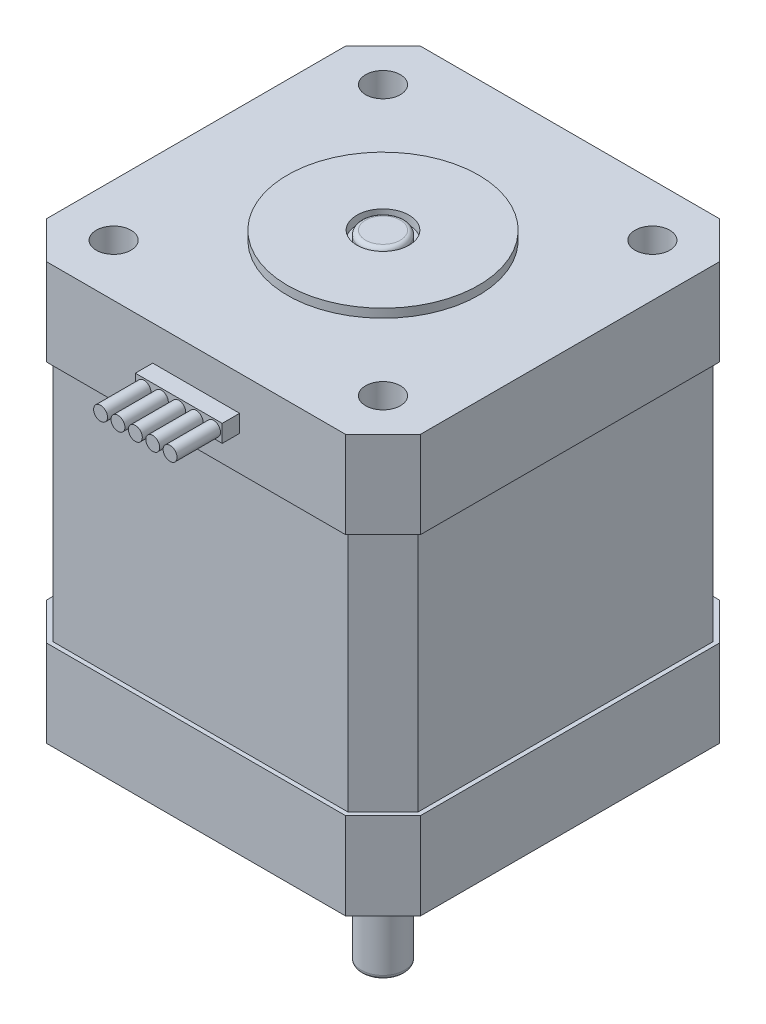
ISO-10303-21;
HEADER;
FILE_DESCRIPTION(('STEP AP214'),'2;1');
FILE_NAME('part.step','',(''),(''),'','','');
FILE_SCHEMA(('AUTOMOTIVE_DESIGN { 1 0 10303 214 1 1 1 1 }'));
ENDSEC;
DATA;
#1=APPLICATION_CONTEXT('core data for automotive mechanical design processes');
#2=APPLICATION_PROTOCOL_DEFINITION('international standard','automotive_design',2000,#1);
#3=PRODUCT_CONTEXT('',#1,'mechanical');
#4=PRODUCT('Part','Part','',(#3));
#5=PRODUCT_RELATED_PRODUCT_CATEGORY('part','',(#4));
#6=PRODUCT_DEFINITION_FORMATION('','',#4);
#7=PRODUCT_DEFINITION_CONTEXT('part definition',#1,'design');
#8=PRODUCT_DEFINITION('design','',#6,#7);
#9=PRODUCT_DEFINITION_SHAPE('','',#8);
#10=(LENGTH_UNIT() NAMED_UNIT(*) SI_UNIT(.MILLI.,.METRE.));
#11=(NAMED_UNIT(*) PLANE_ANGLE_UNIT() SI_UNIT($,.RADIAN.));
#12=(NAMED_UNIT(*) SI_UNIT($,.STERADIAN.) SOLID_ANGLE_UNIT());
#13=UNCERTAINTY_MEASURE_WITH_UNIT(LENGTH_MEASURE(1.E-05),#10,'distance_accuracy_value','');
#14=(GEOMETRIC_REPRESENTATION_CONTEXT(3) GLOBAL_UNCERTAINTY_ASSIGNED_CONTEXT((#13)) GLOBAL_UNIT_ASSIGNED_CONTEXT((#10,
#11,#12)) REPRESENTATION_CONTEXT('',''));
#15=CARTESIAN_POINT('',(0.,0.,0.));
#16=DIRECTION('',(0.,0.,1.));
#17=DIRECTION('',(1.,0.,0.));
#18=AXIS2_PLACEMENT_3D('',#15,#16,#17);
#19=CARTESIAN_POINT('',(17.2071067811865,-10.,21.5));
#20=DIRECTION('',(0.,0.,1.));
#21=DIRECTION('',(1.,0.,0.));
#22=AXIS2_PLACEMENT_3D('',#19,#20,#21);
#23=PLANE('',#22);
#24=DIRECTION('',(1.,0.,0.));
#25=VECTOR('',#24,1.);
#26=CARTESIAN_POINT('',(17.2071067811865,0.,21.5));
#27=LINE('',#26,#25);
#28=CARTESIAN_POINT('',(-17.2071067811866,0.,21.5));
#29=VERTEX_POINT('',#28);
#30=CARTESIAN_POINT('',(17.2071067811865,0.,21.5));
#31=VERTEX_POINT('',#30);
#32=EDGE_CURVE('E323',#29,#31,#27,.T.);
#33=ORIENTED_EDGE('',*,*,#32,.F.);
#34=DIRECTION('',(0.,1.,0.));
#35=VECTOR('',#34,1.);
#36=CARTESIAN_POINT('',(-17.2071067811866,-10.,21.5));
#37=LINE('',#36,#35);
#38=CARTESIAN_POINT('',(-17.2071067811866,-10.,21.5));
#39=VERTEX_POINT('',#38);
#40=EDGE_CURVE('E353',#39,#29,#37,.T.);
#41=ORIENTED_EDGE('',*,*,#40,.F.);
#42=DIRECTION('',(1.,0.,0.));
#43=VECTOR('',#42,1.);
#44=CARTESIAN_POINT('',(17.2071067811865,-10.,21.5));
#45=LINE('',#44,#43);
#46=CARTESIAN_POINT('',(17.2071067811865,-10.,21.5));
#47=VERTEX_POINT('',#46);
#48=EDGE_CURVE('E299',#39,#47,#45,.T.);
#49=ORIENTED_EDGE('',*,*,#48,.T.);
#50=DIRECTION('',(0.,1.,0.));
#51=VECTOR('',#50,1.);
#52=CARTESIAN_POINT('',(17.2071067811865,-10.,21.5));
#53=LINE('',#52,#51);
#54=EDGE_CURVE('E351',#47,#31,#53,.T.);
#55=ORIENTED_EDGE('',*,*,#54,.T.);
#56=EDGE_LOOP('',(#33,#41,#49,#55));
#57=FACE_BOUND('',#56,.T.);
#58=DIRECTION('',(-1.,0.,0.));
#59=VECTOR('',#58,1.);
#60=CARTESIAN_POINT('',(-5.,-4.,21.5));
#61=LINE('',#60,#59);
#62=CARTESIAN_POINT('',(5.,-4.,21.5));
#63=VERTEX_POINT('',#62);
#64=CARTESIAN_POINT('',(-5.,-4.,21.5));
#65=VERTEX_POINT('',#64);
#66=EDGE_CURVE('E1464',#63,#65,#61,.T.);
#67=ORIENTED_EDGE('',*,*,#66,.F.);
#68=DIRECTION('',(0.,1.,0.));
#69=VECTOR('',#68,1.);
#70=CARTESIAN_POINT('',(5.,-6.,21.5));
#71=LINE('',#70,#69);
#72=CARTESIAN_POINT('',(5.,-6.,21.5));
#73=VERTEX_POINT('',#72);
#74=EDGE_CURVE('E252',#73,#63,#71,.T.);
#75=ORIENTED_EDGE('',*,*,#74,.F.);
#76=DIRECTION('',(1.,0.,0.));
#77=VECTOR('',#76,1.);
#78=CARTESIAN_POINT('',(-5.,-6.,21.5));
#79=LINE('',#78,#77);
#80=CARTESIAN_POINT('',(-5.,-6.,21.5));
#81=VERTEX_POINT('',#80);
#82=EDGE_CURVE('E248',#81,#73,#79,.T.);
#83=ORIENTED_EDGE('',*,*,#82,.F.);
#84=DIRECTION('',(0.,-1.,0.));
#85=VECTOR('',#84,1.);
#86=CARTESIAN_POINT('',(-5.,-6.,21.5));
#87=LINE('',#86,#85);
#88=EDGE_CURVE('E1466',#65,#81,#87,.T.);
#89=ORIENTED_EDGE('',*,*,#88,.F.);
#90=EDGE_LOOP('',(#67,#75,#83,#89));
#91=FACE_BOUND('',#90,.T.);
#92=ADVANCED_FACE('F44',(#57,#91),#23,.T.);
#93=CARTESIAN_POINT('',(21.,-48.,21.));
#94=DIRECTION('',(1.,0.,0.));
#95=DIRECTION('',(0.,0.,-1.));
#96=AXIS2_PLACEMENT_3D('',#93,#94,#95);
#97=PLANE('',#96);
#98=DIRECTION('',(0.,0.,-1.));
#99=VECTOR('',#98,1.);
#100=CARTESIAN_POINT('',(21.,-10.,-17.));
#101=LINE('',#100,#99);
#102=CARTESIAN_POINT('',(21.,-10.,17.));
#103=VERTEX_POINT('',#102);
#104=CARTESIAN_POINT('',(21.,-9.99999999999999,-17.));
#105=VERTEX_POINT('',#104);
#106=EDGE_CURVE('E67',#103,#105,#101,.T.);
#107=ORIENTED_EDGE('',*,*,#106,.F.);
#108=DIRECTION('',(0.,1.,0.));
#109=VECTOR('',#108,1.);
#110=CARTESIAN_POINT('',(21.,-48.,17.));
#111=LINE('',#110,#109);
#112=CARTESIAN_POINT('',(21.,-38.,17.));
#113=VERTEX_POINT('',#112);
#114=EDGE_CURVE('E439',#113,#103,#111,.T.);
#115=ORIENTED_EDGE('',*,*,#114,.F.);
#116=DIRECTION('',(0.,0.,1.));
#117=VECTOR('',#116,1.);
#118=CARTESIAN_POINT('',(21.,-38.,17.));
#119=LINE('',#118,#117);
#120=CARTESIAN_POINT('',(21.,-38.,-17.));
#121=VERTEX_POINT('',#120);
#122=EDGE_CURVE('E365',#121,#113,#119,.T.);
#123=ORIENTED_EDGE('',*,*,#122,.F.);
#124=DIRECTION('',(0.,1.,0.));
#125=VECTOR('',#124,1.);
#126=CARTESIAN_POINT('',(21.,-48.,-17.));
#127=LINE('',#126,#125);
#128=EDGE_CURVE('E436',#121,#105,#127,.T.);
#129=ORIENTED_EDGE('',*,*,#128,.T.);
#130=EDGE_LOOP('',(#107,#115,#123,#129));
#131=FACE_BOUND('',#130,.T.);
#132=ADVANCED_FACE('F562',(#131),#97,.T.);
#133=CARTESIAN_POINT('',(-21.,-48.,21.));
#134=DIRECTION('',(0.,0.,1.));
#135=DIRECTION('',(1.,0.,0.));
#136=AXIS2_PLACEMENT_3D('',#133,#134,#135);
#137=PLANE('',#136);
#138=DIRECTION('',(1.,0.,0.));
#139=VECTOR('',#138,1.);
#140=CARTESIAN_POINT('',(17.,-10.,21.));
#141=LINE('',#140,#139);
#142=CARTESIAN_POINT('',(-17.,-10.,21.));
#143=VERTEX_POINT('',#142);
#144=CARTESIAN_POINT('',(17.,-10.,21.));
#145=VERTEX_POINT('',#144);
#146=EDGE_CURVE('E282',#143,#145,#141,.T.);
#147=ORIENTED_EDGE('',*,*,#146,.F.);
#148=DIRECTION('',(0.,1.,0.));
#149=VECTOR('',#148,1.);
#150=CARTESIAN_POINT('',(-17.,-48.,21.));
#151=LINE('',#150,#149);
#152=CARTESIAN_POINT('',(-17.,-38.,21.));
#153=VERTEX_POINT('',#152);
#154=EDGE_CURVE('E445',#153,#143,#151,.T.);
#155=ORIENTED_EDGE('',*,*,#154,.F.);
#156=DIRECTION('',(-1.,0.,0.));
#157=VECTOR('',#156,1.);
#158=CARTESIAN_POINT('',(-17.,-38.,21.));
#159=LINE('',#158,#157);
#160=CARTESIAN_POINT('',(17.,-38.,21.));
#161=VERTEX_POINT('',#160);
#162=EDGE_CURVE('E369',#161,#153,#159,.T.);
#163=ORIENTED_EDGE('',*,*,#162,.F.);
#164=DIRECTION('',(0.,1.,0.));
#165=VECTOR('',#164,1.);
#166=CARTESIAN_POINT('',(17.,-48.,21.));
#167=LINE('',#166,#165);
#168=EDGE_CURVE('E442',#161,#145,#167,.T.);
#169=ORIENTED_EDGE('',*,*,#168,.T.);
#170=EDGE_LOOP('',(#147,#155,#163,#169));
#171=FACE_BOUND('',#170,.T.);
#172=ADVANCED_FACE('F568',(#171),#137,.T.);
#173=CARTESIAN_POINT('',(-21.,-48.,21.));
#174=DIRECTION('',(-1.,0.,0.));
#175=DIRECTION('',(0.,0.,1.));
#176=AXIS2_PLACEMENT_3D('',#173,#174,#175);
#177=PLANE('',#176);
#178=DIRECTION('',(0.,0.,1.));
#179=VECTOR('',#178,1.);
#180=CARTESIAN_POINT('',(-21.,-10.,17.));
#181=LINE('',#180,#179);
#182=CARTESIAN_POINT('',(-21.,-10.,-17.));
#183=VERTEX_POINT('',#182);
#184=CARTESIAN_POINT('',(-21.,-10.,17.));
#185=VERTEX_POINT('',#184);
#186=EDGE_CURVE('E278',#183,#185,#181,.T.);
#187=ORIENTED_EDGE('',*,*,#186,.F.);
#188=DIRECTION('',(0.,1.,0.));
#189=VECTOR('',#188,1.);
#190=CARTESIAN_POINT('',(-21.,-48.,-17.));
#191=LINE('',#190,#189);
#192=CARTESIAN_POINT('',(-21.,-38.,-17.));
#193=VERTEX_POINT('',#192);
#194=EDGE_CURVE('E451',#193,#183,#191,.T.);
#195=ORIENTED_EDGE('',*,*,#194,.F.);
#196=DIRECTION('',(0.,0.,-1.));
#197=VECTOR('',#196,1.);
#198=CARTESIAN_POINT('',(-21.,-38.,-17.));
#199=LINE('',#198,#197);
#200=CARTESIAN_POINT('',(-21.,-38.,17.));
#201=VERTEX_POINT('',#200);
#202=EDGE_CURVE('E357',#201,#193,#199,.T.);
#203=ORIENTED_EDGE('',*,*,#202,.F.);
#204=DIRECTION('',(0.,1.,0.));
#205=VECTOR('',#204,1.);
#206=CARTESIAN_POINT('',(-21.,-48.,17.));
#207=LINE('',#206,#205);
#208=EDGE_CURVE('E448',#201,#185,#207,.T.);
#209=ORIENTED_EDGE('',*,*,#208,.T.);
#210=EDGE_LOOP('',(#187,#195,#203,#209));
#211=FACE_BOUND('',#210,.T.);
#212=ADVANCED_FACE('F716',(#211),#177,.T.);
#213=CARTESIAN_POINT('',(-21.,-48.,-21.));
#214=DIRECTION('',(0.,0.,-1.));
#215=DIRECTION('',(-1.,0.,0.));
#216=AXIS2_PLACEMENT_3D('',#213,#214,#215);
#217=PLANE('',#216);
#218=DIRECTION('',(-1.,0.,0.));
#219=VECTOR('',#218,1.);
#220=CARTESIAN_POINT('',(-17.,-10.,-21.));
#221=LINE('',#220,#219);
#222=CARTESIAN_POINT('',(17.,-10.,-21.));
#223=VERTEX_POINT('',#222);
#224=CARTESIAN_POINT('',(-17.,-10.,-21.));
#225=VERTEX_POINT('',#224);
#226=EDGE_CURVE('E289',#223,#225,#221,.T.);
#227=ORIENTED_EDGE('',*,*,#226,.F.);
#228=DIRECTION('',(0.,1.,0.));
#229=VECTOR('',#228,1.);
#230=CARTESIAN_POINT('',(17.,-48.,-21.));
#231=LINE('',#230,#229);
#232=CARTESIAN_POINT('',(17.,-38.,-21.));
#233=VERTEX_POINT('',#232);
#234=EDGE_CURVE('E422',#233,#223,#231,.T.);
#235=ORIENTED_EDGE('',*,*,#234,.F.);
#236=DIRECTION('',(1.,0.,0.));
#237=VECTOR('',#236,1.);
#238=CARTESIAN_POINT('',(17.,-38.,-21.));
#239=LINE('',#238,#237);
#240=CARTESIAN_POINT('',(-17.,-38.,-21.));
#241=VERTEX_POINT('',#240);
#242=EDGE_CURVE('E361',#241,#233,#239,.T.);
#243=ORIENTED_EDGE('',*,*,#242,.F.);
#244=DIRECTION('',(0.,1.,0.));
#245=VECTOR('',#244,1.);
#246=CARTESIAN_POINT('',(-17.,-48.,-21.));
#247=LINE('',#246,#245);
#248=EDGE_CURVE('E454',#241,#225,#247,.T.);
#249=ORIENTED_EDGE('',*,*,#248,.T.);
#250=EDGE_LOOP('',(#227,#235,#243,#249));
#251=FACE_BOUND('',#250,.T.);
#252=ADVANCED_FACE('F640',(#251),#217,.T.);
#253=CARTESIAN_POINT('',(-17.,-48.,-21.));
#254=DIRECTION('',(0.707106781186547,0.,0.707106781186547));
#255=DIRECTION('',(0.707106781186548,0.,-0.707106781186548));
#256=AXIS2_PLACEMENT_3D('',#253,#254,#255);
#257=PLANE('',#256);
#258=ORIENTED_EDGE('',*,*,#194,.T.);
#259=DIRECTION('',(-0.707106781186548,0.,0.707106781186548));
#260=VECTOR('',#259,1.);
#261=CARTESIAN_POINT('',(-21.,-10.,-17.));
#262=LINE('',#261,#260);
#263=EDGE_CURVE('E274',#225,#183,#262,.T.);
#264=ORIENTED_EDGE('',*,*,#263,.F.);
#265=ORIENTED_EDGE('',*,*,#248,.F.);
#266=DIRECTION('',(0.707106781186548,0.,-0.707106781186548));
#267=VECTOR('',#266,1.);
#268=CARTESIAN_POINT('',(-17.,-38.,-21.));
#269=LINE('',#268,#267);
#270=EDGE_CURVE('E359',#193,#241,#269,.T.);
#271=ORIENTED_EDGE('',*,*,#270,.F.);
#272=EDGE_LOOP('',(#258,#264,#265,#271));
#273=FACE_BOUND('',#272,.T.);
#274=ADVANCED_FACE('F636',(#273),#257,.F.);
#275=CARTESIAN_POINT('',(-17.,-48.,21.));
#276=DIRECTION('',(0.707106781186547,0.,-0.707106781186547));
#277=DIRECTION('',(-0.707106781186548,0.,-0.707106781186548));
#278=AXIS2_PLACEMENT_3D('',#275,#276,#277);
#279=PLANE('',#278);
#280=ORIENTED_EDGE('',*,*,#154,.T.);
#281=DIRECTION('',(0.707106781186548,0.,0.707106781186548));
#282=VECTOR('',#281,1.);
#283=CARTESIAN_POINT('',(-17.,-10.,21.));
#284=LINE('',#283,#282);
#285=EDGE_CURVE('E280',#185,#143,#284,.T.);
#286=ORIENTED_EDGE('',*,*,#285,.F.);
#287=ORIENTED_EDGE('',*,*,#208,.F.);
#288=DIRECTION('',(-0.707106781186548,0.,-0.707106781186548));
#289=VECTOR('',#288,1.);
#290=CARTESIAN_POINT('',(-21.,-38.,17.));
#291=LINE('',#290,#289);
#292=EDGE_CURVE('E342',#153,#201,#291,.T.);
#293=ORIENTED_EDGE('',*,*,#292,.F.);
#294=EDGE_LOOP('',(#280,#286,#287,#293));
#295=FACE_BOUND('',#294,.T.);
#296=ADVANCED_FACE('F632',(#295),#279,.F.);
#297=CARTESIAN_POINT('',(17.,-48.,21.));
#298=DIRECTION('',(-0.707106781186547,0.,-0.707106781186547));
#299=DIRECTION('',(-0.707106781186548,0.,0.707106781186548));
#300=AXIS2_PLACEMENT_3D('',#297,#298,#299);
#301=PLANE('',#300);
#302=ORIENTED_EDGE('',*,*,#114,.T.);
#303=DIRECTION('',(0.707106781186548,0.,-0.707106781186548));
#304=VECTOR('',#303,1.);
#305=CARTESIAN_POINT('',(21.,-10.,17.));
#306=LINE('',#305,#304);
#307=EDGE_CURVE('E284',#145,#103,#306,.T.);
#308=ORIENTED_EDGE('',*,*,#307,.F.);
#309=ORIENTED_EDGE('',*,*,#168,.F.);
#310=DIRECTION('',(-0.707106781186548,0.,0.707106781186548));
#311=VECTOR('',#310,1.);
#312=CARTESIAN_POINT('',(17.,-38.,21.));
#313=LINE('',#312,#311);
#314=EDGE_CURVE('E367',#113,#161,#313,.T.);
#315=ORIENTED_EDGE('',*,*,#314,.F.);
#316=EDGE_LOOP('',(#302,#308,#309,#315));
#317=FACE_BOUND('',#316,.T.);
#318=ADVANCED_FACE('F628',(#317),#301,.F.);
#319=CARTESIAN_POINT('',(17.,-48.,-21.));
#320=DIRECTION('',(-0.707106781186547,0.,0.707106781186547));
#321=DIRECTION('',(0.707106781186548,0.,0.707106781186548));
#322=AXIS2_PLACEMENT_3D('',#319,#320,#321);
#323=PLANE('',#322);
#324=ORIENTED_EDGE('',*,*,#234,.T.);
#325=DIRECTION('',(-0.707106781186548,0.,-0.707106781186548));
#326=VECTOR('',#325,1.);
#327=CARTESIAN_POINT('',(17.,-10.,-21.));
#328=LINE('',#327,#326);
#329=EDGE_CURVE('E287',#105,#223,#328,.T.);
#330=ORIENTED_EDGE('',*,*,#329,.F.);
#331=ORIENTED_EDGE('',*,*,#128,.F.);
#332=DIRECTION('',(0.707106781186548,0.,0.707106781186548));
#333=VECTOR('',#332,1.);
#334=CARTESIAN_POINT('',(21.,-38.,-17.));
#335=LINE('',#334,#333);
#336=EDGE_CURVE('E363',#233,#121,#335,.T.);
#337=ORIENTED_EDGE('',*,*,#336,.F.);
#338=EDGE_LOOP('',(#324,#330,#331,#337));
#339=FACE_BOUND('',#338,.T.);
#340=ADVANCED_FACE('F624',(#339),#323,.F.);
#341=CARTESIAN_POINT('',(-21.5,-38.,-17.2071067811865));
#342=DIRECTION('',(-1.,0.,0.));
#343=DIRECTION('',(0.,0.,1.));
#344=AXIS2_PLACEMENT_3D('',#341,#342,#343);
#345=PLANE('',#344);
#346=DIRECTION('',(0.,0.,-1.));
#347=VECTOR('',#346,1.);
#348=CARTESIAN_POINT('',(-21.5,-48.,-17.2071067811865));
#349=LINE('',#348,#347);
#350=CARTESIAN_POINT('',(-21.5,-48.,17.2071067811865));
#351=VERTEX_POINT('',#350);
#352=CARTESIAN_POINT('',(-21.5,-48.,-17.2071067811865));
#353=VERTEX_POINT('',#352);
#354=EDGE_CURVE('E371',#351,#353,#349,.T.);
#355=ORIENTED_EDGE('',*,*,#354,.F.);
#356=DIRECTION('',(0.,-1.,0.));
#357=VECTOR('',#356,1.);
#358=CARTESIAN_POINT('',(-21.5,-38.,17.2071067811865));
#359=LINE('',#358,#357);
#360=CARTESIAN_POINT('',(-21.5,-38.,17.2071067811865));
#361=VERTEX_POINT('',#360);
#362=EDGE_CURVE('E420',#361,#351,#359,.T.);
#363=ORIENTED_EDGE('',*,*,#362,.F.);
#364=DIRECTION('',(0.,0.,-1.));
#365=VECTOR('',#364,1.);
#366=CARTESIAN_POINT('',(-21.5,-38.,-17.2071067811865));
#367=LINE('',#366,#365);
#368=CARTESIAN_POINT('',(-21.5,-38.,-17.2071067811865));
#369=VERTEX_POINT('',#368);
#370=EDGE_CURVE('E372',#361,#369,#367,.T.);
#371=ORIENTED_EDGE('',*,*,#370,.T.);
#372=DIRECTION('',(0.,-1.,0.));
#373=VECTOR('',#372,1.);
#374=CARTESIAN_POINT('',(-21.5,-38.,-17.2071067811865));
#375=LINE('',#374,#373);
#376=EDGE_CURVE('E397',#369,#353,#375,.T.);
#377=ORIENTED_EDGE('',*,*,#376,.T.);
#378=EDGE_LOOP('',(#355,#363,#371,#377));
#379=FACE_BOUND('',#378,.T.);
#380=ADVANCED_FACE('F598',(#379),#345,.T.);
#381=CARTESIAN_POINT('',(-21.5,-38.,17.2071067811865));
#382=DIRECTION('',(-0.707106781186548,0.,0.707106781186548));
#383=DIRECTION('',(0.707106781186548,0.,0.707106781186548));
#384=AXIS2_PLACEMENT_3D('',#381,#382,#383);
#385=PLANE('',#384);
#386=DIRECTION('',(-0.707106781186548,0.,-0.707106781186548));
#387=VECTOR('',#386,1.);
#388=CARTESIAN_POINT('',(-21.5,-48.,17.2071067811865));
#389=LINE('',#388,#387);
#390=CARTESIAN_POINT('',(-17.2071067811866,-48.,21.5));
#391=VERTEX_POINT('',#390);
#392=EDGE_CURVE('E376',#391,#351,#389,.T.);
#393=ORIENTED_EDGE('',*,*,#392,.F.);
#394=DIRECTION('',(0.,-1.,0.));
#395=VECTOR('',#394,1.);
#396=CARTESIAN_POINT('',(-17.2071067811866,-38.,21.5));
#397=LINE('',#396,#395);
#398=CARTESIAN_POINT('',(-17.2071067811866,-38.,21.5));
#399=VERTEX_POINT('',#398);
#400=EDGE_CURVE('E423',#399,#391,#397,.T.);
#401=ORIENTED_EDGE('',*,*,#400,.F.);
#402=DIRECTION('',(-0.707106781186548,0.,-0.707106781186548));
#403=VECTOR('',#402,1.);
#404=CARTESIAN_POINT('',(-21.5,-38.,17.2071067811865));
#405=LINE('',#404,#403);
#406=EDGE_CURVE('E394',#399,#361,#405,.T.);
#407=ORIENTED_EDGE('',*,*,#406,.T.);
#408=ORIENTED_EDGE('',*,*,#362,.T.);
#409=EDGE_LOOP('',(#393,#401,#407,#408));
#410=FACE_BOUND('',#409,.T.);
#411=ADVANCED_FACE('F594',(#410),#385,.T.);
#412=CARTESIAN_POINT('',(-17.2071067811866,-38.,21.5));
#413=DIRECTION('',(0.,0.,1.));
#414=DIRECTION('',(1.,0.,0.));
#415=AXIS2_PLACEMENT_3D('',#412,#413,#414);
#416=PLANE('',#415);
#417=DIRECTION('',(-1.,0.,0.));
#418=VECTOR('',#417,1.);
#419=CARTESIAN_POINT('',(-17.2071067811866,-48.,21.5));
#420=LINE('',#419,#418);
#421=CARTESIAN_POINT('',(17.2071067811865,-48.,21.5));
#422=VERTEX_POINT('',#421);
#423=EDGE_CURVE('E415',#422,#391,#420,.T.);
#424=ORIENTED_EDGE('',*,*,#423,.F.);
#425=DIRECTION('',(0.,-1.,0.));
#426=VECTOR('',#425,1.);
#427=CARTESIAN_POINT('',(17.2071067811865,-38.,21.5));
#428=LINE('',#427,#426);
#429=CARTESIAN_POINT('',(17.2071067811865,-38.,21.5));
#430=VERTEX_POINT('',#429);
#431=EDGE_CURVE('E425',#430,#422,#428,.T.);
#432=ORIENTED_EDGE('',*,*,#431,.F.);
#433=DIRECTION('',(-1.,0.,0.));
#434=VECTOR('',#433,1.);
#435=CARTESIAN_POINT('',(-17.2071067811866,-38.,21.5));
#436=LINE('',#435,#434);
#437=EDGE_CURVE('E391',#430,#399,#436,.T.);
#438=ORIENTED_EDGE('',*,*,#437,.T.);
#439=ORIENTED_EDGE('',*,*,#400,.T.);
#440=EDGE_LOOP('',(#424,#432,#438,#439));
#441=FACE_BOUND('',#440,.T.);
#442=ADVANCED_FACE('F597',(#441),#416,.T.);
#443=CARTESIAN_POINT('',(17.2071067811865,-38.,21.5));
#444=DIRECTION('',(0.707106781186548,0.,0.707106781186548));
#445=DIRECTION('',(0.707106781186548,0.,-0.707106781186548));
#446=AXIS2_PLACEMENT_3D('',#443,#444,#445);
#447=PLANE('',#446);
#448=DIRECTION('',(-0.707106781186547,0.,0.707106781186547));
#449=VECTOR('',#448,1.);
#450=CARTESIAN_POINT('',(17.2071067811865,-48.,21.5));
#451=LINE('',#450,#449);
#452=CARTESIAN_POINT('',(21.5,-48.,17.2071067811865));
#453=VERTEX_POINT('',#452);
#454=EDGE_CURVE('E412',#453,#422,#451,.T.);
#455=ORIENTED_EDGE('',*,*,#454,.F.);
#456=DIRECTION('',(0.,-1.,0.));
#457=VECTOR('',#456,1.);
#458=CARTESIAN_POINT('',(21.5,-38.,17.2071067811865));
#459=LINE('',#458,#457);
#460=CARTESIAN_POINT('',(21.5,-38.,17.2071067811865));
#461=VERTEX_POINT('',#460);
#462=EDGE_CURVE('E427',#461,#453,#459,.T.);
#463=ORIENTED_EDGE('',*,*,#462,.F.);
#464=DIRECTION('',(-0.707106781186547,0.,0.707106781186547));
#465=VECTOR('',#464,1.);
#466=CARTESIAN_POINT('',(17.2071067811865,-38.,21.5));
#467=LINE('',#466,#465);
#468=EDGE_CURVE('E388',#461,#430,#467,.T.);
#469=ORIENTED_EDGE('',*,*,#468,.T.);
#470=ORIENTED_EDGE('',*,*,#431,.T.);
#471=EDGE_LOOP('',(#455,#463,#469,#470));
#472=FACE_BOUND('',#471,.T.);
#473=ADVANCED_FACE('F602',(#472),#447,.T.);
#474=CARTESIAN_POINT('',(21.5,-38.,17.2071067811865));
#475=DIRECTION('',(1.,0.,0.));
#476=DIRECTION('',(0.,0.,-1.));
#477=AXIS2_PLACEMENT_3D('',#474,#475,#476);
#478=PLANE('',#477);
#479=DIRECTION('',(0.,0.,1.));
#480=VECTOR('',#479,1.);
#481=CARTESIAN_POINT('',(21.5,-48.,17.2071067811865));
#482=LINE('',#481,#480);
#483=CARTESIAN_POINT('',(21.5,-48.,-17.2071067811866));
#484=VERTEX_POINT('',#483);
#485=EDGE_CURVE('E409',#484,#453,#482,.T.);
#486=ORIENTED_EDGE('',*,*,#485,.F.);
#487=DIRECTION('',(0.,-1.,0.));
#488=VECTOR('',#487,1.);
#489=CARTESIAN_POINT('',(21.5,-38.,-17.2071067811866));
#490=LINE('',#489,#488);
#491=CARTESIAN_POINT('',(21.5,-38.,-17.2071067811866));
#492=VERTEX_POINT('',#491);
#493=EDGE_CURVE('E429',#492,#484,#490,.T.);
#494=ORIENTED_EDGE('',*,*,#493,.F.);
#495=DIRECTION('',(0.,0.,1.));
#496=VECTOR('',#495,1.);
#497=CARTESIAN_POINT('',(21.5,-38.,17.2071067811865));
#498=LINE('',#497,#496);
#499=EDGE_CURVE('E385',#492,#461,#498,.T.);
#500=ORIENTED_EDGE('',*,*,#499,.T.);
#501=ORIENTED_EDGE('',*,*,#462,.T.);
#502=EDGE_LOOP('',(#486,#494,#500,#501));
#503=FACE_BOUND('',#502,.T.);
#504=ADVANCED_FACE('F606',(#503),#478,.T.);
#505=CARTESIAN_POINT('',(21.5,-38.,-17.2071067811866));
#506=DIRECTION('',(0.707106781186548,0.,-0.707106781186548));
#507=DIRECTION('',(-0.707106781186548,0.,-0.707106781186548));
#508=AXIS2_PLACEMENT_3D('',#505,#506,#507);
#509=PLANE('',#508);
#510=DIRECTION('',(0.707106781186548,0.,0.707106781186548));
#511=VECTOR('',#510,1.);
#512=CARTESIAN_POINT('',(21.5,-48.,-17.2071067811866));
#513=LINE('',#512,#511);
#514=CARTESIAN_POINT('',(17.2071067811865,-48.,-21.5));
#515=VERTEX_POINT('',#514);
#516=EDGE_CURVE('E406',#515,#484,#513,.T.);
#517=ORIENTED_EDGE('',*,*,#516,.F.);
#518=DIRECTION('',(0.,-1.,0.));
#519=VECTOR('',#518,1.);
#520=CARTESIAN_POINT('',(17.2071067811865,-38.,-21.5));
#521=LINE('',#520,#519);
#522=CARTESIAN_POINT('',(17.2071067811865,-38.,-21.5));
#523=VERTEX_POINT('',#522);
#524=EDGE_CURVE('E431',#523,#515,#521,.T.);
#525=ORIENTED_EDGE('',*,*,#524,.F.);
#526=DIRECTION('',(0.707106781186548,0.,0.707106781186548));
#527=VECTOR('',#526,1.);
#528=CARTESIAN_POINT('',(21.5,-38.,-17.2071067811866));
#529=LINE('',#528,#527);
#530=EDGE_CURVE('E382',#523,#492,#529,.T.);
#531=ORIENTED_EDGE('',*,*,#530,.T.);
#532=ORIENTED_EDGE('',*,*,#493,.T.);
#533=EDGE_LOOP('',(#517,#525,#531,#532));
#534=FACE_BOUND('',#533,.T.);
#535=ADVANCED_FACE('F610',(#534),#509,.T.);
#536=CARTESIAN_POINT('',(17.2071067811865,-38.,-21.5));
#537=DIRECTION('',(0.,0.,-1.));
#538=DIRECTION('',(-1.,0.,0.));
#539=AXIS2_PLACEMENT_3D('',#536,#537,#538);
#540=PLANE('',#539);
#541=DIRECTION('',(1.,0.,0.));
#542=VECTOR('',#541,1.);
#543=CARTESIAN_POINT('',(17.2071067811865,-48.,-21.5));
#544=LINE('',#543,#542);
#545=CARTESIAN_POINT('',(-17.2071067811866,-48.,-21.5));
#546=VERTEX_POINT('',#545);
#547=EDGE_CURVE('E403',#546,#515,#544,.T.);
#548=ORIENTED_EDGE('',*,*,#547,.F.);
#549=DIRECTION('',(0.,-1.,0.));
#550=VECTOR('',#549,1.);
#551=CARTESIAN_POINT('',(-17.2071067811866,-38.,-21.5));
#552=LINE('',#551,#550);
#553=CARTESIAN_POINT('',(-17.2071067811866,-38.,-21.5));
#554=VERTEX_POINT('',#553);
#555=EDGE_CURVE('E433',#554,#546,#552,.T.);
#556=ORIENTED_EDGE('',*,*,#555,.F.);
#557=DIRECTION('',(1.,0.,0.));
#558=VECTOR('',#557,1.);
#559=CARTESIAN_POINT('',(17.2071067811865,-38.,-21.5));
#560=LINE('',#559,#558);
#561=EDGE_CURVE('E379',#554,#523,#560,.T.);
#562=ORIENTED_EDGE('',*,*,#561,.T.);
#563=ORIENTED_EDGE('',*,*,#524,.T.);
#564=EDGE_LOOP('',(#548,#556,#562,#563));
#565=FACE_BOUND('',#564,.T.);
#566=ADVANCED_FACE('F614',(#565),#540,.T.);
#567=CARTESIAN_POINT('',(-17.2071067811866,-38.,-21.5));
#568=DIRECTION('',(-0.707106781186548,0.,-0.707106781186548));
#569=DIRECTION('',(-0.707106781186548,0.,0.707106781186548));
#570=AXIS2_PLACEMENT_3D('',#567,#568,#569);
#571=PLANE('',#570);
#572=DIRECTION('',(0.707106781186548,0.,-0.707106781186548));
#573=VECTOR('',#572,1.);
#574=CARTESIAN_POINT('',(-17.2071067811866,-48.,-21.5));
#575=LINE('',#574,#573);
#576=EDGE_CURVE('E400',#353,#546,#575,.T.);
#577=ORIENTED_EDGE('',*,*,#576,.F.);
#578=ORIENTED_EDGE('',*,*,#376,.F.);
#579=DIRECTION('',(0.707106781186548,0.,-0.707106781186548));
#580=VECTOR('',#579,1.);
#581=CARTESIAN_POINT('',(-17.2071067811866,-38.,-21.5));
#582=LINE('',#581,#580);
#583=EDGE_CURVE('E375',#369,#554,#582,.T.);
#584=ORIENTED_EDGE('',*,*,#583,.T.);
#585=ORIENTED_EDGE('',*,*,#555,.T.);
#586=EDGE_LOOP('',(#577,#578,#584,#585));
#587=FACE_BOUND('',#586,.T.);
#588=ADVANCED_FACE('F592',(#587),#571,.T.);
#589=CARTESIAN_POINT('',(0.,-38.,0.));
#590=DIRECTION('',(0.,1.,0.));
#591=DIRECTION('',(0.,0.,1.));
#592=AXIS2_PLACEMENT_3D('',#589,#590,#591);
#593=PLANE('',#592);
#594=ORIENTED_EDGE('',*,*,#292,.T.);
#595=ORIENTED_EDGE('',*,*,#202,.T.);
#596=ORIENTED_EDGE('',*,*,#270,.T.);
#597=ORIENTED_EDGE('',*,*,#242,.T.);
#598=ORIENTED_EDGE('',*,*,#336,.T.);
#599=ORIENTED_EDGE('',*,*,#122,.T.);
#600=ORIENTED_EDGE('',*,*,#314,.T.);
#601=ORIENTED_EDGE('',*,*,#162,.T.);
#602=EDGE_LOOP('',(#594,#595,#596,#597,#598,#599,#600,#601));
#603=FACE_BOUND('',#602,.T.);
#604=ORIENTED_EDGE('',*,*,#370,.F.);
#605=ORIENTED_EDGE('',*,*,#406,.F.);
#606=ORIENTED_EDGE('',*,*,#437,.F.);
#607=ORIENTED_EDGE('',*,*,#468,.F.);
#608=ORIENTED_EDGE('',*,*,#499,.F.);
#609=ORIENTED_EDGE('',*,*,#530,.F.);
#610=ORIENTED_EDGE('',*,*,#561,.F.);
#611=ORIENTED_EDGE('',*,*,#583,.F.);
#612=EDGE_LOOP('',(#604,#605,#606,#607,#608,#609,#610,#611));
#613=FACE_BOUND('',#612,.T.);
#614=ADVANCED_FACE('F588',(#603,#613),#593,.T.);
#615=CARTESIAN_POINT('',(-15.5,-43.5,-15.5));
#616=DIRECTION('',(0.,1.,0.));
#617=DIRECTION('',(0.,0.,1.));
#618=AXIS2_PLACEMENT_3D('',#615,#616,#617);
#619=PLANE('',#618);
#620=CARTESIAN_POINT('',(-15.5,-43.5,-15.5));
#621=DIRECTION('',(0.,-1.,0.));
#622=DIRECTION('',(0.,0.,1.));
#623=AXIS2_PLACEMENT_3D('',#620,#621,#622);
#624=CIRCLE('',#623,2.);
#625=CARTESIAN_POINT('',(-15.5,-43.5,-13.5));
#626=VERTEX_POINT('',#625);
#627=EDGE_CURVE('E502',#626,#626,#624,.T.);
#628=ORIENTED_EDGE('',*,*,#627,.T.);
#629=EDGE_LOOP('',(#628));
#630=FACE_BOUND('',#629,.T.);
#631=ADVANCED_FACE('F591',(#630),#619,.F.);
#632=CARTESIAN_POINT('',(-15.5,-43.5,15.5));
#633=DIRECTION('',(0.,-1.,0.));
#634=DIRECTION('',(0.,0.,-1.));
#635=AXIS2_PLACEMENT_3D('',#632,#633,#634);
#636=PLANE('',#635);
#637=CARTESIAN_POINT('',(-15.5,-43.5,15.5));
#638=DIRECTION('',(0.,-1.,0.));
#639=DIRECTION('',(0.,0.,-1.));
#640=AXIS2_PLACEMENT_3D('',#637,#638,#639);
#641=CIRCLE('',#640,2.);
#642=CARTESIAN_POINT('',(-15.5,-43.5,13.5));
#643=VERTEX_POINT('',#642);
#644=EDGE_CURVE('E496',#643,#643,#641,.T.);
#645=ORIENTED_EDGE('',*,*,#644,.T.);
#646=EDGE_LOOP('',(#645));
#647=FACE_BOUND('',#646,.T.);
#648=ADVANCED_FACE('F688',(#647),#636,.T.);
#649=CARTESIAN_POINT('',(15.5,-43.5,-15.5));
#650=DIRECTION('',(0.,-1.,0.));
#651=DIRECTION('',(0.,0.,-1.));
#652=AXIS2_PLACEMENT_3D('',#649,#650,#651);
#653=PLANE('',#652);
#654=CARTESIAN_POINT('',(15.5,-43.5,-15.5));
#655=DIRECTION('',(0.,-1.,0.));
#656=DIRECTION('',(0.,0.,-1.));
#657=AXIS2_PLACEMENT_3D('',#654,#655,#656);
#658=CIRCLE('',#657,2.);
#659=CARTESIAN_POINT('',(15.5,-43.5,-17.5));
#660=VERTEX_POINT('',#659);
#661=EDGE_CURVE('E490',#660,#660,#658,.T.);
#662=ORIENTED_EDGE('',*,*,#661,.T.);
#663=EDGE_LOOP('',(#662));
#664=FACE_BOUND('',#663,.T.);
#665=ADVANCED_FACE('F679',(#664),#653,.T.);
#666=CARTESIAN_POINT('',(15.5,-43.5,15.5));
#667=DIRECTION('',(0.,1.,0.));
#668=DIRECTION('',(0.,0.,1.));
#669=AXIS2_PLACEMENT_3D('',#666,#667,#668);
#670=PLANE('',#669);
#671=CARTESIAN_POINT('',(15.5,-43.5,15.5));
#672=DIRECTION('',(0.,-1.,0.));
#673=DIRECTION('',(0.,0.,1.));
#674=AXIS2_PLACEMENT_3D('',#671,#672,#673);
#675=CIRCLE('',#674,2.);
#676=CARTESIAN_POINT('',(15.5,-43.5,17.5));
#677=VERTEX_POINT('',#676);
#678=EDGE_CURVE('E484',#677,#677,#675,.T.);
#679=ORIENTED_EDGE('',*,*,#678,.T.);
#680=EDGE_LOOP('',(#679));
#681=FACE_BOUND('',#680,.T.);
#682=ADVANCED_FACE('F675',(#681),#670,.F.);
#683=CARTESIAN_POINT('',(-15.5,-43.5,-15.5));
#684=DIRECTION('',(0.,-1.,0.));
#685=DIRECTION('',(0.,0.,-1.));
#686=AXIS2_PLACEMENT_3D('',#683,#684,#685);
#687=CYLINDRICAL_SURFACE('',#686,2.);
#688=ORIENTED_EDGE('',*,*,#627,.F.);
#689=EDGE_LOOP('',(#688));
#690=FACE_BOUND('',#689,.T.);
#691=CARTESIAN_POINT('',(-15.5,-48.,-15.5));
#692=DIRECTION('',(0.,-1.,0.));
#693=DIRECTION('',(0.,0.,1.));
#694=AXIS2_PLACEMENT_3D('',#691,#692,#693);
#695=CIRCLE('',#694,2.);
#696=CARTESIAN_POINT('',(-15.5,-48.,-13.5));
#697=VERTEX_POINT('',#696);
#698=EDGE_CURVE('E499',#697,#697,#695,.T.);
#699=ORIENTED_EDGE('',*,*,#698,.T.);
#700=EDGE_LOOP('',(#699));
#701=FACE_BOUND('',#700,.T.);
#702=ADVANCED_FACE('F678',(#690,#701),#687,.F.);
#703=CARTESIAN_POINT('',(-15.5,-43.5,15.5));
#704=DIRECTION('',(0.,-1.,0.));
#705=DIRECTION('',(0.,0.,-1.));
#706=AXIS2_PLACEMENT_3D('',#703,#704,#705);
#707=CYLINDRICAL_SURFACE('',#706,2.);
#708=ORIENTED_EDGE('',*,*,#644,.F.);
#709=EDGE_LOOP('',(#708));
#710=FACE_BOUND('',#709,.T.);
#711=CARTESIAN_POINT('',(-15.5,-48.,15.5));
#712=DIRECTION('',(0.,-1.,0.));
#713=DIRECTION('',(0.,0.,-1.));
#714=AXIS2_PLACEMENT_3D('',#711,#712,#713);
#715=CIRCLE('',#714,2.);
#716=CARTESIAN_POINT('',(-15.5,-48.,13.5));
#717=VERTEX_POINT('',#716);
#718=EDGE_CURVE('E493',#717,#717,#715,.T.);
#719=ORIENTED_EDGE('',*,*,#718,.T.);
#720=EDGE_LOOP('',(#719));
#721=FACE_BOUND('',#720,.T.);
#722=ADVANCED_FACE('F692',(#710,#721),#707,.F.);
#723=CARTESIAN_POINT('',(15.5,-43.5,-15.5));
#724=DIRECTION('',(0.,-1.,0.));
#725=DIRECTION('',(0.,0.,-1.));
#726=AXIS2_PLACEMENT_3D('',#723,#724,#725);
#727=CYLINDRICAL_SURFACE('',#726,2.);
#728=ORIENTED_EDGE('',*,*,#661,.F.);
#729=EDGE_LOOP('',(#728));
#730=FACE_BOUND('',#729,.T.);
#731=CARTESIAN_POINT('',(15.5,-48.,-15.5));
#732=DIRECTION('',(0.,-1.,0.));
#733=DIRECTION('',(0.,0.,-1.));
#734=AXIS2_PLACEMENT_3D('',#731,#732,#733);
#735=CIRCLE('',#734,2.);
#736=CARTESIAN_POINT('',(15.5,-48.,-17.5));
#737=VERTEX_POINT('',#736);
#738=EDGE_CURVE('E487',#737,#737,#735,.T.);
#739=ORIENTED_EDGE('',*,*,#738,.T.);
#740=EDGE_LOOP('',(#739));
#741=FACE_BOUND('',#740,.T.);
#742=ADVANCED_FACE('F684',(#730,#741),#727,.F.);
#743=CARTESIAN_POINT('',(15.5,-43.5,15.5));
#744=DIRECTION('',(0.,-1.,0.));
#745=DIRECTION('',(0.,0.,-1.));
#746=AXIS2_PLACEMENT_3D('',#743,#744,#745);
#747=CYLINDRICAL_SURFACE('',#746,2.);
#748=ORIENTED_EDGE('',*,*,#678,.F.);
#749=EDGE_LOOP('',(#748));
#750=FACE_BOUND('',#749,.T.);
#751=CARTESIAN_POINT('',(15.5,-48.,15.5));
#752=DIRECTION('',(0.,-1.,0.));
#753=DIRECTION('',(0.,0.,1.));
#754=AXIS2_PLACEMENT_3D('',#751,#752,#753);
#755=CIRCLE('',#754,2.);
#756=CARTESIAN_POINT('',(15.5,-48.,17.5));
#757=VERTEX_POINT('',#756);
#758=EDGE_CURVE('E481',#757,#757,#755,.T.);
#759=ORIENTED_EDGE('',*,*,#758,.T.);
#760=EDGE_LOOP('',(#759));
#761=FACE_BOUND('',#760,.T.);
#762=ADVANCED_FACE('F681',(#750,#761),#747,.F.);
#763=CARTESIAN_POINT('',(0.,-48.,0.));
#764=DIRECTION('',(0.,-1.,0.));
#765=DIRECTION('',(0.,0.,-1.));
#766=AXIS2_PLACEMENT_3D('',#763,#764,#765);
#767=PLANE('',#766);
#768=CARTESIAN_POINT('',(0.,-48.,0.));
#769=DIRECTION('',(0.,-1.,0.));
#770=DIRECTION('',(0.,0.,-1.));
#771=AXIS2_PLACEMENT_3D('',#768,#769,#770);
#772=CIRCLE('',#771,11.);
#773=CARTESIAN_POINT('',(0.,-48.,-11.));
#774=VERTEX_POINT('',#773);
#775=EDGE_CURVE('E257',#774,#774,#772,.T.);
#776=ORIENTED_EDGE('',*,*,#775,.F.);
#777=EDGE_LOOP('',(#776));
#778=FACE_BOUND('',#777,.T.);
#779=ORIENTED_EDGE('',*,*,#758,.F.);
#780=EDGE_LOOP('',(#779));
#781=FACE_BOUND('',#780,.T.);
#782=ORIENTED_EDGE('',*,*,#738,.F.);
#783=EDGE_LOOP('',(#782));
#784=FACE_BOUND('',#783,.T.);
#785=ORIENTED_EDGE('',*,*,#718,.F.);
#786=EDGE_LOOP('',(#785));
#787=FACE_BOUND('',#786,.T.);
#788=ORIENTED_EDGE('',*,*,#698,.F.);
#789=EDGE_LOOP('',(#788));
#790=FACE_BOUND('',#789,.T.);
#791=ORIENTED_EDGE('',*,*,#354,.T.);
#792=ORIENTED_EDGE('',*,*,#576,.T.);
#793=ORIENTED_EDGE('',*,*,#547,.T.);
#794=ORIENTED_EDGE('',*,*,#516,.T.);
#795=ORIENTED_EDGE('',*,*,#485,.T.);
#796=ORIENTED_EDGE('',*,*,#454,.T.);
#797=ORIENTED_EDGE('',*,*,#423,.T.);
#798=ORIENTED_EDGE('',*,*,#392,.T.);
#799=EDGE_LOOP('',(#791,#792,#793,#794,#795,#796,#797,#798));
#800=FACE_BOUND('',#799,.T.);
#801=ADVANCED_FACE('F586',(#778,#781,#784,#787,#790,#800),#767,.T.);
#802=CARTESIAN_POINT('',(-21.5,-10.,17.2071067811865));
#803=DIRECTION('',(-1.,0.,0.));
#804=DIRECTION('',(0.,0.,1.));
#805=AXIS2_PLACEMENT_3D('',#802,#803,#804);
#806=PLANE('',#805);
#807=DIRECTION('',(0.,0.,1.));
#808=VECTOR('',#807,1.);
#809=CARTESIAN_POINT('',(-21.5,0.,17.2071067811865));
#810=LINE('',#809,#808);
#811=CARTESIAN_POINT('',(-21.5,0.,-17.2071067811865));
#812=VERTEX_POINT('',#811);
#813=CARTESIAN_POINT('',(-21.5,0.,17.2071067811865));
#814=VERTEX_POINT('',#813);
#815=EDGE_CURVE('E291',#812,#814,#810,.T.);
#816=ORIENTED_EDGE('',*,*,#815,.F.);
#817=DIRECTION('',(0.,1.,0.));
#818=VECTOR('',#817,1.);
#819=CARTESIAN_POINT('',(-21.5,-10.,-17.2071067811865));
#820=LINE('',#819,#818);
#821=CARTESIAN_POINT('',(-21.5,-10.,-17.2071067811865));
#822=VERTEX_POINT('',#821);
#823=EDGE_CURVE('E340',#822,#812,#820,.T.);
#824=ORIENTED_EDGE('',*,*,#823,.F.);
#825=DIRECTION('',(0.,0.,1.));
#826=VECTOR('',#825,1.);
#827=CARTESIAN_POINT('',(-21.5,-10.,17.2071067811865));
#828=LINE('',#827,#826);
#829=CARTESIAN_POINT('',(-21.5,-10.,17.2071067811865));
#830=VERTEX_POINT('',#829);
#831=EDGE_CURVE('E292',#822,#830,#828,.T.);
#832=ORIENTED_EDGE('',*,*,#831,.T.);
#833=DIRECTION('',(0.,1.,0.));
#834=VECTOR('',#833,1.);
#835=CARTESIAN_POINT('',(-21.5,-10.,17.2071067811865));
#836=LINE('',#835,#834);
#837=EDGE_CURVE('E317',#830,#814,#836,.T.);
#838=ORIENTED_EDGE('',*,*,#837,.T.);
#839=EDGE_LOOP('',(#816,#824,#832,#838));
#840=FACE_BOUND('',#839,.T.);
#841=ADVANCED_FACE('F582',(#840),#806,.T.);
#842=CARTESIAN_POINT('',(-21.5,-10.,-17.2071067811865));
#843=DIRECTION('',(-0.707106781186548,0.,-0.707106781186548));
#844=DIRECTION('',(-0.707106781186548,0.,0.707106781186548));
#845=AXIS2_PLACEMENT_3D('',#842,#843,#844);
#846=PLANE('',#845);
#847=DIRECTION('',(-0.707106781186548,0.,0.707106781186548));
#848=VECTOR('',#847,1.);
#849=CARTESIAN_POINT('',(-21.5,0.,-17.2071067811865));
#850=LINE('',#849,#848);
#851=CARTESIAN_POINT('',(-17.2071067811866,0.,-21.5));
#852=VERTEX_POINT('',#851);
#853=EDGE_CURVE('E296',#852,#812,#850,.T.);
#854=ORIENTED_EDGE('',*,*,#853,.F.);
#855=DIRECTION('',(0.,1.,0.));
#856=VECTOR('',#855,1.);
#857=CARTESIAN_POINT('',(-17.2071067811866,-10.,-21.5));
#858=LINE('',#857,#856);
#859=CARTESIAN_POINT('',(-17.2071067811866,-10.,-21.5));
#860=VERTEX_POINT('',#859);
#861=EDGE_CURVE('E343',#860,#852,#858,.T.);
#862=ORIENTED_EDGE('',*,*,#861,.F.);
#863=DIRECTION('',(-0.707106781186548,0.,0.707106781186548));
#864=VECTOR('',#863,1.);
#865=CARTESIAN_POINT('',(-21.5,-10.,-17.2071067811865));
#866=LINE('',#865,#864);
#867=EDGE_CURVE('E314',#860,#822,#866,.T.);
#868=ORIENTED_EDGE('',*,*,#867,.T.);
#869=ORIENTED_EDGE('',*,*,#823,.T.);
#870=EDGE_LOOP('',(#854,#862,#868,#869));
#871=FACE_BOUND('',#870,.T.);
#872=ADVANCED_FACE('F585',(#871),#846,.T.);
#873=CARTESIAN_POINT('',(-17.2071067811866,-10.,-21.5));
#874=DIRECTION('',(0.,0.,-1.));
#875=DIRECTION('',(-1.,0.,0.));
#876=AXIS2_PLACEMENT_3D('',#873,#874,#875);
#877=PLANE('',#876);
#878=DIRECTION('',(-1.,0.,0.));
#879=VECTOR('',#878,1.);
#880=CARTESIAN_POINT('',(-17.2071067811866,0.,-21.5));
#881=LINE('',#880,#879);
#882=CARTESIAN_POINT('',(17.2071067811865,0.,-21.5));
#883=VERTEX_POINT('',#882);
#884=EDGE_CURVE('E335',#883,#852,#881,.T.);
#885=ORIENTED_EDGE('',*,*,#884,.F.);
#886=DIRECTION('',(0.,1.,0.));
#887=VECTOR('',#886,1.);
#888=CARTESIAN_POINT('',(17.2071067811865,-10.,-21.5));
#889=LINE('',#888,#887);
#890=CARTESIAN_POINT('',(17.2071067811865,-10.,-21.5));
#891=VERTEX_POINT('',#890);
#892=EDGE_CURVE('E345',#891,#883,#889,.T.);
#893=ORIENTED_EDGE('',*,*,#892,.F.);
#894=DIRECTION('',(-1.,0.,0.));
#895=VECTOR('',#894,1.);
#896=CARTESIAN_POINT('',(-17.2071067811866,-10.,-21.5));
#897=LINE('',#896,#895);
#898=EDGE_CURVE('E311',#891,#860,#897,.T.);
#899=ORIENTED_EDGE('',*,*,#898,.T.);
#900=ORIENTED_EDGE('',*,*,#861,.T.);
#901=EDGE_LOOP('',(#885,#893,#899,#900));
#902=FACE_BOUND('',#901,.T.);
#903=ADVANCED_FACE('F811',(#902),#877,.T.);
#904=CARTESIAN_POINT('',(17.2071067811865,-10.,-21.5));
#905=DIRECTION('',(0.707106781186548,0.,-0.707106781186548));
#906=DIRECTION('',(-0.707106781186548,0.,-0.707106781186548));
#907=AXIS2_PLACEMENT_3D('',#904,#905,#906);
#908=PLANE('',#907);
#909=DIRECTION('',(-0.707106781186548,0.,-0.707106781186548));
#910=VECTOR('',#909,1.);
#911=CARTESIAN_POINT('',(17.2071067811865,0.,-21.5));
#912=LINE('',#911,#910);
#913=CARTESIAN_POINT('',(21.5,0.,-17.2071067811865));
#914=VERTEX_POINT('',#913);
#915=EDGE_CURVE('E332',#914,#883,#912,.T.);
#916=ORIENTED_EDGE('',*,*,#915,.F.);
#917=DIRECTION('',(0.,1.,0.));
#918=VECTOR('',#917,1.);
#919=CARTESIAN_POINT('',(21.5,-10.,-17.2071067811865));
#920=LINE('',#919,#918);
#921=CARTESIAN_POINT('',(21.5,-10.,-17.2071067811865));
#922=VERTEX_POINT('',#921);
#923=EDGE_CURVE('E347',#922,#914,#920,.T.);
#924=ORIENTED_EDGE('',*,*,#923,.F.);
#925=DIRECTION('',(-0.707106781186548,0.,-0.707106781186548));
#926=VECTOR('',#925,1.);
#927=CARTESIAN_POINT('',(17.2071067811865,-10.,-21.5));
#928=LINE('',#927,#926);
#929=EDGE_CURVE('E308',#922,#891,#928,.T.);
#930=ORIENTED_EDGE('',*,*,#929,.T.);
#931=ORIENTED_EDGE('',*,*,#892,.T.);
#932=EDGE_LOOP('',(#916,#924,#930,#931));
#933=FACE_BOUND('',#932,.T.);
#934=ADVANCED_FACE('F815',(#933),#908,.T.);
#935=CARTESIAN_POINT('',(21.5,-10.,-17.2071067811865));
#936=DIRECTION('',(1.,0.,0.));
#937=DIRECTION('',(0.,0.,-1.));
#938=AXIS2_PLACEMENT_3D('',#935,#936,#937);
#939=PLANE('',#938);
#940=DIRECTION('',(0.,0.,-1.));
#941=VECTOR('',#940,1.);
#942=CARTESIAN_POINT('',(21.5,0.,-17.2071067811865));
#943=LINE('',#942,#941);
#944=CARTESIAN_POINT('',(21.5,0.,17.2071067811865));
#945=VERTEX_POINT('',#944);
#946=EDGE_CURVE('E329',#945,#914,#943,.T.);
#947=ORIENTED_EDGE('',*,*,#946,.F.);
#948=DIRECTION('',(0.,1.,0.));
#949=VECTOR('',#948,1.);
#950=CARTESIAN_POINT('',(21.5,-10.,17.2071067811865));
#951=LINE('',#950,#949);
#952=CARTESIAN_POINT('',(21.5,-10.,17.2071067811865));
#953=VERTEX_POINT('',#952);
#954=EDGE_CURVE('E349',#953,#945,#951,.T.);
#955=ORIENTED_EDGE('',*,*,#954,.F.);
#956=DIRECTION('',(0.,0.,-1.));
#957=VECTOR('',#956,1.);
#958=CARTESIAN_POINT('',(21.5,-10.,-17.2071067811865));
#959=LINE('',#958,#957);
#960=EDGE_CURVE('E305',#953,#922,#959,.T.);
#961=ORIENTED_EDGE('',*,*,#960,.T.);
#962=ORIENTED_EDGE('',*,*,#923,.T.);
#963=EDGE_LOOP('',(#947,#955,#961,#962));
#964=FACE_BOUND('',#963,.T.);
#965=ADVANCED_FACE('F818',(#964),#939,.T.);
#966=CARTESIAN_POINT('',(21.5,-10.,17.2071067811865));
#967=DIRECTION('',(0.707106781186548,0.,0.707106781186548));
#968=DIRECTION('',(0.707106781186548,0.,-0.707106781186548));
#969=AXIS2_PLACEMENT_3D('',#966,#967,#968);
#970=PLANE('',#969);
#971=DIRECTION('',(0.707106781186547,0.,-0.707106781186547));
#972=VECTOR('',#971,1.);
#973=CARTESIAN_POINT('',(21.5,0.,17.2071067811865));
#974=LINE('',#973,#972);
#975=EDGE_CURVE('E326',#31,#945,#974,.T.);
#976=ORIENTED_EDGE('',*,*,#975,.F.);
#977=ORIENTED_EDGE('',*,*,#54,.F.);
#978=DIRECTION('',(0.707106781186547,0.,-0.707106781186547));
#979=VECTOR('',#978,1.);
#980=CARTESIAN_POINT('',(21.5,-10.,17.2071067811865));
#981=LINE('',#980,#979);
#982=EDGE_CURVE('E302',#47,#953,#981,.T.);
#983=ORIENTED_EDGE('',*,*,#982,.T.);
#984=ORIENTED_EDGE('',*,*,#954,.T.);
#985=EDGE_LOOP('',(#976,#977,#983,#984));
#986=FACE_BOUND('',#985,.T.);
#987=ADVANCED_FACE('F575',(#986),#970,.T.);
#988=CARTESIAN_POINT('',(-17.2071067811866,-10.,21.5));
#989=DIRECTION('',(-0.707106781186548,0.,0.707106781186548));
#990=DIRECTION('',(0.707106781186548,0.,0.707106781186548));
#991=AXIS2_PLACEMENT_3D('',#988,#989,#990);
#992=PLANE('',#991);
#993=DIRECTION('',(0.707106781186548,0.,0.707106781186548));
#994=VECTOR('',#993,1.);
#995=CARTESIAN_POINT('',(-17.2071067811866,0.,21.5));
#996=LINE('',#995,#994);
#997=EDGE_CURVE('E320',#814,#29,#996,.T.);
#998=ORIENTED_EDGE('',*,*,#997,.F.);
#999=ORIENTED_EDGE('',*,*,#837,.F.);
#1000=DIRECTION('',(0.707106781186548,0.,0.707106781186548));
#1001=VECTOR('',#1000,1.);
#1002=CARTESIAN_POINT('',(-17.2071067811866,-10.,21.5));
#1003=LINE('',#1002,#1001);
#1004=EDGE_CURVE('E295',#830,#39,#1003,.T.);
#1005=ORIENTED_EDGE('',*,*,#1004,.T.);
#1006=ORIENTED_EDGE('',*,*,#40,.T.);
#1007=EDGE_LOOP('',(#998,#999,#1005,#1006));
#1008=FACE_BOUND('',#1007,.T.);
#1009=ADVANCED_FACE('F577',(#1008),#992,.T.);
#1010=CARTESIAN_POINT('',(0.,-10.,0.));
#1011=DIRECTION('',(0.,-1.,0.));
#1012=DIRECTION('',(0.,0.,-1.));
#1013=AXIS2_PLACEMENT_3D('',#1010,#1011,#1012);
#1014=PLANE('',#1013);
#1015=ORIENTED_EDGE('',*,*,#263,.T.);
#1016=ORIENTED_EDGE('',*,*,#186,.T.);
#1017=ORIENTED_EDGE('',*,*,#285,.T.);
#1018=ORIENTED_EDGE('',*,*,#146,.T.);
#1019=ORIENTED_EDGE('',*,*,#307,.T.);
#1020=ORIENTED_EDGE('',*,*,#106,.T.);
#1021=ORIENTED_EDGE('',*,*,#329,.T.);
#1022=ORIENTED_EDGE('',*,*,#226,.T.);
#1023=EDGE_LOOP('',(#1015,#1016,#1017,#1018,#1019,#1020,#1021,#1022));
#1024=FACE_BOUND('',#1023,.T.);
#1025=ORIENTED_EDGE('',*,*,#831,.F.);
#1026=ORIENTED_EDGE('',*,*,#867,.F.);
#1027=ORIENTED_EDGE('',*,*,#898,.F.);
#1028=ORIENTED_EDGE('',*,*,#929,.F.);
#1029=ORIENTED_EDGE('',*,*,#960,.F.);
#1030=ORIENTED_EDGE('',*,*,#982,.F.);
#1031=ORIENTED_EDGE('',*,*,#48,.F.);
#1032=ORIENTED_EDGE('',*,*,#1004,.F.);
#1033=EDGE_LOOP('',(#1025,#1026,#1027,#1028,#1029,#1030,#1031,#1032));
#1034=FACE_BOUND('',#1033,.T.);
#1035=ADVANCED_FACE('F580',(#1024,#1034),#1014,.T.);
#1036=CARTESIAN_POINT('',(-15.5,-4.5,-15.5));
#1037=DIRECTION('',(0.,1.,0.));
#1038=DIRECTION('',(0.,0.,1.));
#1039=AXIS2_PLACEMENT_3D('',#1036,#1037,#1038);
#1040=PLANE('',#1039);
#1041=CARTESIAN_POINT('',(-15.5,-4.5,-15.5));
#1042=DIRECTION('',(0.,1.,0.));
#1043=DIRECTION('',(0.,0.,1.));
#1044=AXIS2_PLACEMENT_3D('',#1041,#1042,#1043);
#1045=CIRCLE('',#1044,2.);
#1046=CARTESIAN_POINT('',(-15.5,-4.5,-13.5));
#1047=VERTEX_POINT('',#1046);
#1048=EDGE_CURVE('E478',#1047,#1047,#1045,.T.);
#1049=ORIENTED_EDGE('',*,*,#1048,.T.);
#1050=EDGE_LOOP('',(#1049));
#1051=FACE_BOUND('',#1050,.T.);
#1052=ADVANCED_FACE('F664',(#1051),#1040,.T.);
#1053=CARTESIAN_POINT('',(15.5,-4.5,-15.5));
#1054=DIRECTION('',(0.,-1.,0.));
#1055=DIRECTION('',(0.,0.,-1.));
#1056=AXIS2_PLACEMENT_3D('',#1053,#1054,#1055);
#1057=PLANE('',#1056);
#1058=CARTESIAN_POINT('',(15.5,-4.5,-15.5));
#1059=DIRECTION('',(0.,1.,0.));
#1060=DIRECTION('',(0.,0.,-1.));
#1061=AXIS2_PLACEMENT_3D('',#1058,#1059,#1060);
#1062=CIRCLE('',#1061,2.);
#1063=CARTESIAN_POINT('',(15.5,-4.5,-17.5));
#1064=VERTEX_POINT('',#1063);
#1065=EDGE_CURVE('E472',#1064,#1064,#1062,.T.);
#1066=ORIENTED_EDGE('',*,*,#1065,.T.);
#1067=EDGE_LOOP('',(#1066));
#1068=FACE_BOUND('',#1067,.T.);
#1069=ADVANCED_FACE('F656',(#1068),#1057,.F.);
#1070=CARTESIAN_POINT('',(15.5,-4.5,15.5));
#1071=DIRECTION('',(0.,1.,0.));
#1072=DIRECTION('',(0.,0.,1.));
#1073=AXIS2_PLACEMENT_3D('',#1070,#1071,#1072);
#1074=PLANE('',#1073);
#1075=CARTESIAN_POINT('',(15.5,-4.5,15.5));
#1076=DIRECTION('',(0.,1.,0.));
#1077=DIRECTION('',(0.,0.,1.));
#1078=AXIS2_PLACEMENT_3D('',#1075,#1076,#1077);
#1079=CIRCLE('',#1078,2.);
#1080=CARTESIAN_POINT('',(15.5,-4.5,17.5));
#1081=VERTEX_POINT('',#1080);
#1082=EDGE_CURVE('E466',#1081,#1081,#1079,.T.);
#1083=ORIENTED_EDGE('',*,*,#1082,.T.);
#1084=EDGE_LOOP('',(#1083));
#1085=FACE_BOUND('',#1084,.T.);
#1086=ADVANCED_FACE('F646',(#1085),#1074,.T.);
#1087=CARTESIAN_POINT('',(-15.5,-4.5,15.5));
#1088=DIRECTION('',(0.,-1.,0.));
#1089=DIRECTION('',(0.,0.,-1.));
#1090=AXIS2_PLACEMENT_3D('',#1087,#1088,#1089);
#1091=PLANE('',#1090);
#1092=CARTESIAN_POINT('',(-15.5,-4.5,15.5));
#1093=DIRECTION('',(0.,1.,0.));
#1094=DIRECTION('',(0.,0.,-1.));
#1095=AXIS2_PLACEMENT_3D('',#1092,#1093,#1094);
#1096=CIRCLE('',#1095,2.);
#1097=CARTESIAN_POINT('',(-15.5,-4.5,13.5));
#1098=VERTEX_POINT('',#1097);
#1099=EDGE_CURVE('E460',#1098,#1098,#1096,.T.);
#1100=ORIENTED_EDGE('',*,*,#1099,.T.);
#1101=EDGE_LOOP('',(#1100));
#1102=FACE_BOUND('',#1101,.T.);
#1103=ADVANCED_FACE('F642',(#1102),#1091,.F.);
#1104=CARTESIAN_POINT('',(-15.5,-4.5,-15.5));
#1105=DIRECTION('',(0.,1.,0.));
#1106=DIRECTION('',(0.,0.,1.));
#1107=AXIS2_PLACEMENT_3D('',#1104,#1105,#1106);
#1108=CYLINDRICAL_SURFACE('',#1107,2.);
#1109=ORIENTED_EDGE('',*,*,#1048,.F.);
#1110=EDGE_LOOP('',(#1109));
#1111=FACE_BOUND('',#1110,.T.);
#1112=CARTESIAN_POINT('',(-15.5,0.,-15.5));
#1113=DIRECTION('',(0.,1.,0.));
#1114=DIRECTION('',(0.,0.,1.));
#1115=AXIS2_PLACEMENT_3D('',#1112,#1113,#1114);
#1116=CIRCLE('',#1115,2.);
#1117=CARTESIAN_POINT('',(-15.5,0.,-13.5));
#1118=VERTEX_POINT('',#1117);
#1119=EDGE_CURVE('E475',#1118,#1118,#1116,.T.);
#1120=ORIENTED_EDGE('',*,*,#1119,.T.);
#1121=EDGE_LOOP('',(#1120));
#1122=FACE_BOUND('',#1121,.T.);
#1123=ADVANCED_FACE('F645',(#1111,#1122),#1108,.F.);
#1124=CARTESIAN_POINT('',(15.5,-4.5,-15.5));
#1125=DIRECTION('',(0.,1.,0.));
#1126=DIRECTION('',(0.,0.,1.));
#1127=AXIS2_PLACEMENT_3D('',#1124,#1125,#1126);
#1128=CYLINDRICAL_SURFACE('',#1127,2.);
#1129=ORIENTED_EDGE('',*,*,#1065,.F.);
#1130=EDGE_LOOP('',(#1129));
#1131=FACE_BOUND('',#1130,.T.);
#1132=CARTESIAN_POINT('',(15.5,0.,-15.5));
#1133=DIRECTION('',(0.,1.,0.));
#1134=DIRECTION('',(0.,0.,-1.));
#1135=AXIS2_PLACEMENT_3D('',#1132,#1133,#1134);
#1136=CIRCLE('',#1135,2.);
#1137=CARTESIAN_POINT('',(15.5,0.,-17.5));
#1138=VERTEX_POINT('',#1137);
#1139=EDGE_CURVE('E469',#1138,#1138,#1136,.T.);
#1140=ORIENTED_EDGE('',*,*,#1139,.T.);
#1141=EDGE_LOOP('',(#1140));
#1142=FACE_BOUND('',#1141,.T.);
#1143=ADVANCED_FACE('F660',(#1131,#1142),#1128,.F.);
#1144=CARTESIAN_POINT('',(15.5,-4.5,15.5));
#1145=DIRECTION('',(0.,1.,0.));
#1146=DIRECTION('',(0.,0.,1.));
#1147=AXIS2_PLACEMENT_3D('',#1144,#1145,#1146);
#1148=CYLINDRICAL_SURFACE('',#1147,2.);
#1149=ORIENTED_EDGE('',*,*,#1082,.F.);
#1150=EDGE_LOOP('',(#1149));
#1151=FACE_BOUND('',#1150,.T.);
#1152=CARTESIAN_POINT('',(15.5,0.,15.5));
#1153=DIRECTION('',(0.,1.,0.));
#1154=DIRECTION('',(0.,0.,1.));
#1155=AXIS2_PLACEMENT_3D('',#1152,#1153,#1154);
#1156=CIRCLE('',#1155,2.);
#1157=CARTESIAN_POINT('',(15.5,0.,17.5));
#1158=VERTEX_POINT('',#1157);
#1159=EDGE_CURVE('E463',#1158,#1158,#1156,.T.);
#1160=ORIENTED_EDGE('',*,*,#1159,.T.);
#1161=EDGE_LOOP('',(#1160));
#1162=FACE_BOUND('',#1161,.T.);
#1163=ADVANCED_FACE('F652',(#1151,#1162),#1148,.F.);
#1164=CARTESIAN_POINT('',(-15.5,-4.5,15.5));
#1165=DIRECTION('',(0.,1.,0.));
#1166=DIRECTION('',(0.,0.,1.));
#1167=AXIS2_PLACEMENT_3D('',#1164,#1165,#1166);
#1168=CYLINDRICAL_SURFACE('',#1167,2.);
#1169=ORIENTED_EDGE('',*,*,#1099,.F.);
#1170=EDGE_LOOP('',(#1169));
#1171=FACE_BOUND('',#1170,.T.);
#1172=CARTESIAN_POINT('',(-15.5,0.,15.5));
#1173=DIRECTION('',(0.,1.,0.));
#1174=DIRECTION('',(0.,0.,-1.));
#1175=AXIS2_PLACEMENT_3D('',#1172,#1173,#1174);
#1176=CIRCLE('',#1175,2.);
#1177=CARTESIAN_POINT('',(-15.5,0.,13.5));
#1178=VERTEX_POINT('',#1177);
#1179=EDGE_CURVE('E457',#1178,#1178,#1176,.T.);
#1180=ORIENTED_EDGE('',*,*,#1179,.T.);
#1181=EDGE_LOOP('',(#1180));
#1182=FACE_BOUND('',#1181,.T.);
#1183=ADVANCED_FACE('F648',(#1171,#1182),#1168,.F.);
#1184=CARTESIAN_POINT('',(0.,0.,0.));
#1185=DIRECTION('',(0.,-1.,0.));
#1186=DIRECTION('',(0.,0.,-1.));
#1187=AXIS2_PLACEMENT_3D('',#1184,#1185,#1186);
#1188=PLANE('',#1187);
#1189=CARTESIAN_POINT('',(0.,0.,0.));
#1190=DIRECTION('',(0.,-1.,0.));
#1191=DIRECTION('',(0.,0.,-1.));
#1192=AXIS2_PLACEMENT_3D('',#1189,#1190,#1191);
#1193=CIRCLE('',#1192,11.);
#1194=CARTESIAN_POINT('',(0.,0.,-11.));
#1195=VERTEX_POINT('',#1194);
#1196=EDGE_CURVE('E505',#1195,#1195,#1193,.F.);
#1197=ORIENTED_EDGE('',*,*,#1196,.F.);
#1198=EDGE_LOOP('',(#1197));
#1199=FACE_BOUND('',#1198,.T.);
#1200=ORIENTED_EDGE('',*,*,#1179,.F.);
#1201=EDGE_LOOP('',(#1200));
#1202=FACE_BOUND('',#1201,.T.);
#1203=ORIENTED_EDGE('',*,*,#1159,.F.);
#1204=EDGE_LOOP('',(#1203));
#1205=FACE_BOUND('',#1204,.T.);
#1206=ORIENTED_EDGE('',*,*,#1139,.F.);
#1207=EDGE_LOOP('',(#1206));
#1208=FACE_BOUND('',#1207,.T.);
#1209=ORIENTED_EDGE('',*,*,#1119,.F.);
#1210=EDGE_LOOP('',(#1209));
#1211=FACE_BOUND('',#1210,.T.);
#1212=ORIENTED_EDGE('',*,*,#815,.T.);
#1213=ORIENTED_EDGE('',*,*,#997,.T.);
#1214=ORIENTED_EDGE('',*,*,#32,.T.);
#1215=ORIENTED_EDGE('',*,*,#975,.T.);
#1216=ORIENTED_EDGE('',*,*,#946,.T.);
#1217=ORIENTED_EDGE('',*,*,#915,.T.);
#1218=ORIENTED_EDGE('',*,*,#884,.T.);
#1219=ORIENTED_EDGE('',*,*,#853,.T.);
#1220=EDGE_LOOP('',(#1212,#1213,#1214,#1215,#1216,#1217,#1218,#1219));
#1221=FACE_BOUND('',#1220,.T.);
#1222=ADVANCED_FACE('F651',(#1199,#1202,#1205,#1208,#1211,#1221),#1188,.F.);
#1223=CARTESIAN_POINT('',(0.,1.,0.));
#1224=DIRECTION('',(0.,-1.,0.));
#1225=DIRECTION('',(0.,0.,-1.));
#1226=AXIS2_PLACEMENT_3D('',#1223,#1224,#1225);
#1227=CYLINDRICAL_SURFACE('',#1226,3.);
#1228=CARTESIAN_POINT('',(0.,1.,0.));
#1229=DIRECTION('',(0.,1.,0.));
#1230=DIRECTION('',(0.,0.,1.));
#1231=AXIS2_PLACEMENT_3D('',#1228,#1229,#1230);
#1232=CIRCLE('',#1231,3.);
#1233=CARTESIAN_POINT('',(0.,1.,3.));
#1234=VERTEX_POINT('',#1233);
#1235=EDGE_CURVE('E268',#1234,#1234,#1232,.T.);
#1236=ORIENTED_EDGE('',*,*,#1235,.T.);
#1237=EDGE_LOOP('',(#1236));
#1238=FACE_BOUND('',#1237,.T.);
#1239=CARTESIAN_POINT('',(0.,0.,0.));
#1240=DIRECTION('',(0.,1.,0.));
#1241=DIRECTION('',(0.,0.,1.));
#1242=AXIS2_PLACEMENT_3D('',#1239,#1240,#1241);
#1243=CIRCLE('',#1242,3.);
#1244=CARTESIAN_POINT('',(0.,0.,3.));
#1245=VERTEX_POINT('',#1244);
#1246=EDGE_CURVE('E265',#1245,#1245,#1243,.T.);
#1247=ORIENTED_EDGE('',*,*,#1246,.F.);
#1248=EDGE_LOOP('',(#1247));
#1249=FACE_BOUND('',#1248,.T.);
#1250=ADVANCED_FACE('F711',(#1238,#1249),#1227,.F.);
#1251=CARTESIAN_POINT('',(0.,1.,0.));
#1252=DIRECTION('',(0.,-1.,0.));
#1253=DIRECTION('',(0.,0.,-1.));
#1254=AXIS2_PLACEMENT_3D('',#1251,#1252,#1253);
#1255=CYLINDRICAL_SURFACE('',#1254,11.);
#1256=CARTESIAN_POINT('',(0.,1.,0.));
#1257=DIRECTION('',(0.,1.,0.));
#1258=DIRECTION('',(0.,0.,1.));
#1259=AXIS2_PLACEMENT_3D('',#1256,#1257,#1258);
#1260=CIRCLE('',#1259,11.);
#1261=CARTESIAN_POINT('',(0.,1.,11.));
#1262=VERTEX_POINT('',#1261);
#1263=EDGE_CURVE('E271',#1262,#1262,#1260,.T.);
#1264=ORIENTED_EDGE('',*,*,#1263,.F.);
#1265=EDGE_LOOP('',(#1264));
#1266=FACE_BOUND('',#1265,.T.);
#1267=ORIENTED_EDGE('',*,*,#1196,.T.);
#1268=EDGE_LOOP('',(#1267));
#1269=FACE_BOUND('',#1268,.T.);
#1270=ADVANCED_FACE('F799',(#1266,#1269),#1255,.T.);
#1271=CARTESIAN_POINT('',(0.,1.,0.));
#1272=DIRECTION('',(0.,1.,0.));
#1273=DIRECTION('',(0.,0.,1.));
#1274=AXIS2_PLACEMENT_3D('',#1271,#1272,#1273);
#1275=PLANE('',#1274);
#1276=ORIENTED_EDGE('',*,*,#1235,.F.);
#1277=EDGE_LOOP('',(#1276));
#1278=FACE_BOUND('',#1277,.T.);
#1279=ORIENTED_EDGE('',*,*,#1263,.T.);
#1280=EDGE_LOOP('',(#1279));
#1281=FACE_BOUND('',#1280,.T.);
#1282=ADVANCED_FACE('F796',(#1278,#1281),#1275,.T.);
#1283=CARTESIAN_POINT('',(0.,0.,0.));
#1284=DIRECTION('',(0.,-1.,0.));
#1285=DIRECTION('',(0.,0.,-1.));
#1286=AXIS2_PLACEMENT_3D('',#1283,#1284,#1285);
#1287=CIRCLE('',#1286,2.5);
#1288=CARTESIAN_POINT('',(0.,0.,-2.5));
#1289=VERTEX_POINT('',#1288);
#1290=EDGE_CURVE('E510',#1289,#1289,#1287,.F.);
#1291=ORIENTED_EDGE('',*,*,#1290,.F.);
#1292=EDGE_LOOP('',(#1291));
#1293=FACE_BOUND('',#1292,.T.);
#1294=ORIENTED_EDGE('',*,*,#1246,.T.);
#1295=EDGE_LOOP('',(#1294));
#1296=FACE_BOUND('',#1295,.T.);
#1297=ADVANCED_FACE('F713',(#1293,#1296),#1188,.F.);
#1298=CARTESIAN_POINT('',(0.,1.,0.));
#1299=DIRECTION('',(0.,-1.,0.));
#1300=DIRECTION('',(0.,0.,-1.));
#1301=AXIS2_PLACEMENT_3D('',#1298,#1299,#1300);
#1302=CYLINDRICAL_SURFACE('',#1301,2.5);
#1303=CARTESIAN_POINT('',(0.,0.5,0.));
#1304=DIRECTION('',(0.,1.,0.));
#1305=DIRECTION('',(0.,0.,1.));
#1306=AXIS2_PLACEMENT_3D('',#1303,#1304,#1305);
#1307=CIRCLE('',#1306,2.5);
#1308=CARTESIAN_POINT('',(0.,0.5,2.5));
#1309=VERTEX_POINT('',#1308);
#1310=EDGE_CURVE('E522',#1309,#1309,#1307,.F.);
#1311=ORIENTED_EDGE('',*,*,#1310,.T.);
#1312=EDGE_LOOP('',(#1311));
#1313=FACE_BOUND('',#1312,.T.);
#1314=ORIENTED_EDGE('',*,*,#1290,.T.);
#1315=EDGE_LOOP('',(#1314));
#1316=FACE_BOUND('',#1315,.T.);
#1317=ADVANCED_FACE('F789',(#1313,#1316),#1302,.T.);
#1318=CARTESIAN_POINT('',(0.,1.,0.));
#1319=DIRECTION('',(0.,1.,0.));
#1320=DIRECTION('',(0.,0.,1.));
#1321=AXIS2_PLACEMENT_3D('',#1318,#1319,#1320);
#1322=PLANE('',#1321);
#1323=CARTESIAN_POINT('',(0.,1.,0.));
#1324=DIRECTION('',(0.,1.,0.));
#1325=DIRECTION('',(0.,0.,1.));
#1326=AXIS2_PLACEMENT_3D('',#1323,#1324,#1325);
#1327=CIRCLE('',#1326,2.);
#1328=CARTESIAN_POINT('',(0.,1.,2.));
#1329=VERTEX_POINT('',#1328);
#1330=EDGE_CURVE('E519',#1329,#1329,#1327,.T.);
#1331=ORIENTED_EDGE('',*,*,#1330,.T.);
#1332=EDGE_LOOP('',(#1331));
#1333=FACE_BOUND('',#1332,.T.);
#1334=ADVANCED_FACE('F753',(#1333),#1322,.T.);
#1335=CARTESIAN_POINT('',(0.,-50.,0.));
#1336=DIRECTION('',(0.,1.,0.));
#1337=DIRECTION('',(0.,0.,1.));
#1338=AXIS2_PLACEMENT_3D('',#1335,#1336,#1337);
#1339=CYLINDRICAL_SURFACE('',#1338,11.);
#1340=CARTESIAN_POINT('',(0.,-50.,0.));
#1341=DIRECTION('',(0.,-1.,0.));
#1342=DIRECTION('',(0.,0.,-1.));
#1343=AXIS2_PLACEMENT_3D('',#1340,#1341,#1342);
#1344=CIRCLE('',#1343,11.);
#1345=CARTESIAN_POINT('',(0.,-50.,-11.));
#1346=VERTEX_POINT('',#1345);
#1347=EDGE_CURVE('E262',#1346,#1346,#1344,.T.);
#1348=ORIENTED_EDGE('',*,*,#1347,.F.);
#1349=EDGE_LOOP('',(#1348));
#1350=FACE_BOUND('',#1349,.T.);
#1351=ORIENTED_EDGE('',*,*,#775,.T.);
#1352=EDGE_LOOP('',(#1351));
#1353=FACE_BOUND('',#1352,.T.);
#1354=ADVANCED_FACE('F747',(#1350,#1353),#1339,.T.);
#1355=CARTESIAN_POINT('',(0.,-50.,0.));
#1356=DIRECTION('',(0.,-1.,0.));
#1357=DIRECTION('',(0.,0.,-1.));
#1358=AXIS2_PLACEMENT_3D('',#1355,#1356,#1357);
#1359=PLANE('',#1358);
#1360=CARTESIAN_POINT('',(0.,-50.,0.));
#1361=DIRECTION('',(0.,-1.,0.));
#1362=DIRECTION('',(0.,0.,-1.));
#1363=AXIS2_PLACEMENT_3D('',#1360,#1361,#1362);
#1364=CIRCLE('',#1363,2.5);
#1365=CARTESIAN_POINT('',(0.,-50.,-2.5));
#1366=VERTEX_POINT('',#1365);
#1367=EDGE_CURVE('E254',#1366,#1366,#1364,.T.);
#1368=ORIENTED_EDGE('',*,*,#1367,.F.);
#1369=EDGE_LOOP('',(#1368));
#1370=FACE_BOUND('',#1369,.T.);
#1371=ORIENTED_EDGE('',*,*,#1347,.T.);
#1372=EDGE_LOOP('',(#1371));
#1373=FACE_BOUND('',#1372,.T.);
#1374=ADVANCED_FACE('F741',(#1370,#1373),#1359,.T.);
#1375=CARTESIAN_POINT('',(0.,-72.,0.));
#1376=DIRECTION('',(0.,1.,0.));
#1377=DIRECTION('',(0.,0.,1.));
#1378=AXIS2_PLACEMENT_3D('',#1375,#1376,#1377);
#1379=CYLINDRICAL_SURFACE('',#1378,2.5);
#1380=CARTESIAN_POINT('',(0.,-71.5,0.));
#1381=DIRECTION('',(0.,-1.,0.));
#1382=DIRECTION('',(0.,0.,-1.));
#1383=AXIS2_PLACEMENT_3D('',#1380,#1381,#1382);
#1384=CIRCLE('',#1383,2.5);
#1385=CARTESIAN_POINT('',(0.,-71.5,-2.5));
#1386=VERTEX_POINT('',#1385);
#1387=EDGE_CURVE('E516',#1386,#1386,#1384,.F.);
#1388=ORIENTED_EDGE('',*,*,#1387,.T.);
#1389=EDGE_LOOP('',(#1388));
#1390=FACE_BOUND('',#1389,.T.);
#1391=ORIENTED_EDGE('',*,*,#1367,.T.);
#1392=EDGE_LOOP('',(#1391));
#1393=FACE_BOUND('',#1392,.T.);
#1394=ADVANCED_FACE('F732',(#1390,#1393),#1379,.T.);
#1395=CARTESIAN_POINT('',(0.,-72.,0.));
#1396=DIRECTION('',(0.,-1.,0.));
#1397=DIRECTION('',(0.,0.,-1.));
#1398=AXIS2_PLACEMENT_3D('',#1395,#1396,#1397);
#1399=PLANE('',#1398);
#1400=CARTESIAN_POINT('',(0.,-72.,0.));
#1401=DIRECTION('',(0.,-1.,0.));
#1402=DIRECTION('',(0.,0.,-1.));
#1403=AXIS2_PLACEMENT_3D('',#1400,#1401,#1402);
#1404=CIRCLE('',#1403,2.);
#1405=CARTESIAN_POINT('',(0.,-72.,-2.));
#1406=VERTEX_POINT('',#1405);
#1407=EDGE_CURVE('E513',#1406,#1406,#1404,.T.);
#1408=ORIENTED_EDGE('',*,*,#1407,.T.);
#1409=EDGE_LOOP('',(#1408));
#1410=FACE_BOUND('',#1409,.T.);
#1411=ADVANCED_FACE('F725',(#1410),#1399,.T.);
#1412=CARTESIAN_POINT('',(0.,-71.5,0.));
#1413=DIRECTION('',(0.,-1.,0.));
#1414=DIRECTION('',(0.,0.,-1.));
#1415=AXIS2_PLACEMENT_3D('',#1412,#1413,#1414);
#1416=TOROIDAL_SURFACE('',#1415,2.,0.5);
#1417=ORIENTED_EDGE('',*,*,#1387,.F.);
#1418=EDGE_LOOP('',(#1417));
#1419=FACE_BOUND('',#1418,.T.);
#1420=ORIENTED_EDGE('',*,*,#1407,.F.);
#1421=EDGE_LOOP('',(#1420));
#1422=FACE_BOUND('',#1421,.T.);
#1423=ADVANCED_FACE('F723',(#1419,#1422),#1416,.T.);
#1424=CARTESIAN_POINT('',(0.,0.5,0.));
#1425=DIRECTION('',(0.,1.,0.));
#1426=DIRECTION('',(0.,0.,1.));
#1427=AXIS2_PLACEMENT_3D('',#1424,#1425,#1426);
#1428=TOROIDAL_SURFACE('',#1427,2.,0.5);
#1429=ORIENTED_EDGE('',*,*,#1310,.F.);
#1430=EDGE_LOOP('',(#1429));
#1431=FACE_BOUND('',#1430,.T.);
#1432=ORIENTED_EDGE('',*,*,#1330,.F.);
#1433=EDGE_LOOP('',(#1432));
#1434=FACE_BOUND('',#1433,.T.);
#1435=ADVANCED_FACE('F46',(#1431,#1434),#1428,.T.);
#1436=CARTESIAN_POINT('',(5.,-6.,23.5));
#1437=DIRECTION('',(-1.,0.,0.));
#1438=DIRECTION('',(0.,-1.,0.));
#1439=AXIS2_PLACEMENT_3D('',#1436,#1437,#1438);
#1440=PLANE('',#1439);
#1441=ORIENTED_EDGE('',*,*,#74,.T.);
#1442=DIRECTION('',(0.,0.,-1.));
#1443=VECTOR('',#1442,1.);
#1444=CARTESIAN_POINT('',(5.,-4.,23.5));
#1445=LINE('',#1444,#1443);
#1446=CARTESIAN_POINT('',(5.,-4.,23.5));
#1447=VERTEX_POINT('',#1446);
#1448=EDGE_CURVE('E233',#1447,#63,#1445,.T.);
#1449=ORIENTED_EDGE('',*,*,#1448,.F.);
#1450=DIRECTION('',(0.,1.,0.));
#1451=VECTOR('',#1450,1.);
#1452=CARTESIAN_POINT('',(5.,-6.,23.5));
#1453=LINE('',#1452,#1451);
#1454=CARTESIAN_POINT('',(5.,-6.,23.5));
#1455=VERTEX_POINT('',#1454);
#1456=EDGE_CURVE('E240',#1455,#1447,#1453,.T.);
#1457=ORIENTED_EDGE('',*,*,#1456,.F.);
#1458=DIRECTION('',(0.,0.,-1.));
#1459=VECTOR('',#1458,1.);
#1460=CARTESIAN_POINT('',(5.,-6.,23.5));
#1461=LINE('',#1460,#1459);
#1462=EDGE_CURVE('E1462',#1455,#73,#1461,.T.);
#1463=ORIENTED_EDGE('',*,*,#1462,.T.);
#1464=EDGE_LOOP('',(#1441,#1449,#1457,#1463));
#1465=FACE_BOUND('',#1464,.T.);
#1466=ADVANCED_FACE('F250',(#1465),#1440,.F.);
#1467=CARTESIAN_POINT('',(-5.,-4.,23.5));
#1468=DIRECTION('',(0.,-1.,0.));
#1469=DIRECTION('',(0.,0.,-1.));
#1470=AXIS2_PLACEMENT_3D('',#1467,#1468,#1469);
#1471=PLANE('',#1470);
#1472=ORIENTED_EDGE('',*,*,#66,.T.);
#1473=DIRECTION('',(0.,0.,-1.));
#1474=VECTOR('',#1473,1.);
#1475=CARTESIAN_POINT('',(-5.,-4.,23.5));
#1476=LINE('',#1475,#1474);
#1477=CARTESIAN_POINT('',(-5.,-4.,23.5));
#1478=VERTEX_POINT('',#1477);
#1479=EDGE_CURVE('E236',#1478,#65,#1476,.T.);
#1480=ORIENTED_EDGE('',*,*,#1479,.F.);
#1481=DIRECTION('',(-1.,0.,0.));
#1482=VECTOR('',#1481,1.);
#1483=CARTESIAN_POINT('',(-5.,-4.,23.5));
#1484=LINE('',#1483,#1482);
#1485=EDGE_CURVE('E229',#1447,#1478,#1484,.T.);
#1486=ORIENTED_EDGE('',*,*,#1485,.F.);
#1487=ORIENTED_EDGE('',*,*,#1448,.T.);
#1488=EDGE_LOOP('',(#1472,#1480,#1486,#1487));
#1489=FACE_BOUND('',#1488,.T.);
#1490=ADVANCED_FACE('F231',(#1489),#1471,.F.);
#1491=CARTESIAN_POINT('',(-5.,-6.,23.5));
#1492=DIRECTION('',(1.,0.,0.));
#1493=DIRECTION('',(0.,0.,-1.));
#1494=AXIS2_PLACEMENT_3D('',#1491,#1492,#1493);
#1495=PLANE('',#1494);
#1496=ORIENTED_EDGE('',*,*,#88,.T.);
#1497=DIRECTION('',(0.,0.,-1.));
#1498=VECTOR('',#1497,1.);
#1499=CARTESIAN_POINT('',(-5.,-6.,23.5));
#1500=LINE('',#1499,#1498);
#1501=CARTESIAN_POINT('',(-5.,-6.,23.5));
#1502=VERTEX_POINT('',#1501);
#1503=EDGE_CURVE('E59',#1502,#81,#1500,.T.);
#1504=ORIENTED_EDGE('',*,*,#1503,.F.);
#1505=DIRECTION('',(0.,-1.,0.));
#1506=VECTOR('',#1505,1.);
#1507=CARTESIAN_POINT('',(-5.,-6.,23.5));
#1508=LINE('',#1507,#1506);
#1509=EDGE_CURVE('E239',#1478,#1502,#1508,.T.);
#1510=ORIENTED_EDGE('',*,*,#1509,.F.);
#1511=ORIENTED_EDGE('',*,*,#1479,.T.);
#1512=EDGE_LOOP('',(#1496,#1504,#1510,#1511));
#1513=FACE_BOUND('',#1512,.T.);
#1514=ADVANCED_FACE('F947',(#1513),#1495,.F.);
#1515=CARTESIAN_POINT('',(-5.,-6.,23.5));
#1516=DIRECTION('',(0.,1.,0.));
#1517=DIRECTION('',(0.,0.,1.));
#1518=AXIS2_PLACEMENT_3D('',#1515,#1516,#1517);
#1519=PLANE('',#1518);
#1520=ORIENTED_EDGE('',*,*,#82,.T.);
#1521=ORIENTED_EDGE('',*,*,#1462,.F.);
#1522=DIRECTION('',(1.,0.,0.));
#1523=VECTOR('',#1522,1.);
#1524=CARTESIAN_POINT('',(-5.,-6.,23.5));
#1525=LINE('',#1524,#1523);
#1526=EDGE_CURVE('E244',#1502,#1455,#1525,.T.);
#1527=ORIENTED_EDGE('',*,*,#1526,.F.);
#1528=ORIENTED_EDGE('',*,*,#1503,.T.);
#1529=EDGE_LOOP('',(#1520,#1521,#1527,#1528));
#1530=FACE_BOUND('',#1529,.T.);
#1531=ADVANCED_FACE('F541',(#1530),#1519,.F.);
#1532=CARTESIAN_POINT('',(0.,0.,23.5));
#1533=DIRECTION('',(0.,0.,-1.));
#1534=DIRECTION('',(-1.,0.,0.));
#1535=AXIS2_PLACEMENT_3D('',#1532,#1533,#1534);
#1536=PLANE('',#1535);
#1537=CARTESIAN_POINT('',(4.,-5.,23.5));
#1538=DIRECTION('',(0.,0.,-1.));
#1539=DIRECTION('',(-1.,0.,0.));
#1540=AXIS2_PLACEMENT_3D('',#1537,#1538,#1539);
#1541=CIRCLE('',#1540,0.800000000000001);
#1542=CARTESIAN_POINT('',(3.2,-5.,23.5));
#1543=VERTEX_POINT('',#1542);
#1544=EDGE_CURVE('E12',#1543,#1543,#1541,.F.);
#1545=ORIENTED_EDGE('',*,*,#1544,.F.);
#1546=EDGE_LOOP('',(#1545));
#1547=FACE_BOUND('',#1546,.T.);
#1548=CARTESIAN_POINT('',(2.,-5.,23.5));
#1549=DIRECTION('',(0.,0.,-1.));
#1550=DIRECTION('',(-1.,0.,0.));
#1551=AXIS2_PLACEMENT_3D('',#1548,#1549,#1550);
#1552=CIRCLE('',#1551,0.8);
#1553=CARTESIAN_POINT('',(1.2,-5.,23.5));
#1554=VERTEX_POINT('',#1553);
#1555=EDGE_CURVE('E52',#1554,#1554,#1552,.F.);
#1556=ORIENTED_EDGE('',*,*,#1555,.F.);
#1557=EDGE_LOOP('',(#1556));
#1558=FACE_BOUND('',#1557,.T.);
#1559=CARTESIAN_POINT('',(0.,-5.,23.5));
#1560=DIRECTION('',(0.,0.,-1.));
#1561=DIRECTION('',(-1.,0.,0.));
#1562=AXIS2_PLACEMENT_3D('',#1559,#1560,#1561);
#1563=CIRCLE('',#1562,0.8);
#1564=CARTESIAN_POINT('',(-0.799999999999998,-5.,23.5));
#1565=VERTEX_POINT('',#1564);
#1566=EDGE_CURVE('E531',#1565,#1565,#1563,.F.);
#1567=ORIENTED_EDGE('',*,*,#1566,.F.);
#1568=EDGE_LOOP('',(#1567));
#1569=FACE_BOUND('',#1568,.T.);
#1570=CARTESIAN_POINT('',(-2.,-5.,23.5));
#1571=DIRECTION('',(0.,0.,-1.));
#1572=DIRECTION('',(-1.,0.,0.));
#1573=AXIS2_PLACEMENT_3D('',#1570,#1571,#1572);
#1574=CIRCLE('',#1573,0.8);
#1575=CARTESIAN_POINT('',(-2.8,-5.,23.5));
#1576=VERTEX_POINT('',#1575);
#1577=EDGE_CURVE('E528',#1576,#1576,#1574,.F.);
#1578=ORIENTED_EDGE('',*,*,#1577,.F.);
#1579=EDGE_LOOP('',(#1578));
#1580=FACE_BOUND('',#1579,.T.);
#1581=CARTESIAN_POINT('',(-4.,-5.,23.5));
#1582=DIRECTION('',(0.,0.,-1.));
#1583=DIRECTION('',(-1.,0.,0.));
#1584=AXIS2_PLACEMENT_3D('',#1581,#1582,#1583);
#1585=CIRCLE('',#1584,0.8);
#1586=CARTESIAN_POINT('',(-4.8,-5.,23.5));
#1587=VERTEX_POINT('',#1586);
#1588=EDGE_CURVE('E525',#1587,#1587,#1585,.F.);
#1589=ORIENTED_EDGE('',*,*,#1588,.F.);
#1590=EDGE_LOOP('',(#1589));
#1591=FACE_BOUND('',#1590,.T.);
#1592=ORIENTED_EDGE('',*,*,#1456,.T.);
#1593=ORIENTED_EDGE('',*,*,#1485,.T.);
#1594=ORIENTED_EDGE('',*,*,#1509,.T.);
#1595=ORIENTED_EDGE('',*,*,#1526,.T.);
#1596=EDGE_LOOP('',(#1592,#1593,#1594,#1595));
#1597=FACE_BOUND('',#1596,.T.);
#1598=ADVANCED_FACE('F243',(#1547,#1558,#1569,#1580,#1591,#1597),#1536,.F.);
#1599=CARTESIAN_POINT('',(-4.,-5.,28.5));
#1600=DIRECTION('',(0.,0.,-1.));
#1601=DIRECTION('',(-1.,0.,0.));
#1602=AXIS2_PLACEMENT_3D('',#1599,#1600,#1601);
#1603=CYLINDRICAL_SURFACE('',#1602,0.8);
#1604=CARTESIAN_POINT('',(-4.,-5.,28.5));
#1605=DIRECTION('',(0.,0.,1.));
#1606=DIRECTION('',(1.,0.,0.));
#1607=AXIS2_PLACEMENT_3D('',#1604,#1605,#1606);
#1608=CIRCLE('',#1607,0.8);
#1609=CARTESIAN_POINT('',(-3.2,-5.,28.5));
#1610=VERTEX_POINT('',#1609);
#1611=EDGE_CURVE('E1457',#1610,#1610,#1608,.T.);
#1612=ORIENTED_EDGE('',*,*,#1611,.F.);
#1613=EDGE_LOOP('',(#1612));
#1614=FACE_BOUND('',#1613,.T.);
#1615=ORIENTED_EDGE('',*,*,#1588,.T.);
#1616=EDGE_LOOP('',(#1615));
#1617=FACE_BOUND('',#1616,.T.);
#1618=ADVANCED_FACE('F540',(#1614,#1617),#1603,.T.);
#1619=CARTESIAN_POINT('',(-4.,-5.,28.5));
#1620=DIRECTION('',(0.,0.,1.));
#1621=DIRECTION('',(1.,0.,0.));
#1622=AXIS2_PLACEMENT_3D('',#1619,#1620,#1621);
#1623=PLANE('',#1622);
#1624=ORIENTED_EDGE('',*,*,#1611,.T.);
#1625=EDGE_LOOP('',(#1624));
#1626=FACE_BOUND('',#1625,.T.);
#1627=ADVANCED_FACE('F551',(#1626),#1623,.T.);
#1628=CARTESIAN_POINT('',(-2.,-5.,28.5));
#1629=DIRECTION('',(0.,0.,-1.));
#1630=DIRECTION('',(-1.,0.,0.));
#1631=AXIS2_PLACEMENT_3D('',#1628,#1629,#1630);
#1632=CYLINDRICAL_SURFACE('',#1631,0.8);
#1633=CARTESIAN_POINT('',(-2.,-5.,28.5));
#1634=DIRECTION('',(0.,0.,1.));
#1635=DIRECTION('',(1.,0.,0.));
#1636=AXIS2_PLACEMENT_3D('',#1633,#1634,#1635);
#1637=CIRCLE('',#1636,0.8);
#1638=CARTESIAN_POINT('',(-1.2,-5.,28.5));
#1639=VERTEX_POINT('',#1638);
#1640=EDGE_CURVE('E1454',#1639,#1639,#1637,.T.);
#1641=ORIENTED_EDGE('',*,*,#1640,.F.);
#1642=EDGE_LOOP('',(#1641));
#1643=FACE_BOUND('',#1642,.T.);
#1644=ORIENTED_EDGE('',*,*,#1577,.T.);
#1645=EDGE_LOOP('',(#1644));
#1646=FACE_BOUND('',#1645,.T.);
#1647=ADVANCED_FACE('F557',(#1643,#1646),#1632,.T.);
#1648=CARTESIAN_POINT('',(-2.,-5.,28.5));
#1649=DIRECTION('',(0.,0.,1.));
#1650=DIRECTION('',(1.,0.,0.));
#1651=AXIS2_PLACEMENT_3D('',#1648,#1649,#1650);
#1652=PLANE('',#1651);
#1653=ORIENTED_EDGE('',*,*,#1640,.T.);
#1654=EDGE_LOOP('',(#1653));
#1655=FACE_BOUND('',#1654,.T.);
#1656=ADVANCED_FACE('F982',(#1655),#1652,.T.);
#1657=CARTESIAN_POINT('',(0.,-5.,28.5));
#1658=DIRECTION('',(0.,0.,-1.));
#1659=DIRECTION('',(-1.,0.,0.));
#1660=AXIS2_PLACEMENT_3D('',#1657,#1658,#1659);
#1661=CYLINDRICAL_SURFACE('',#1660,0.8);
#1662=CARTESIAN_POINT('',(0.,-5.,28.5));
#1663=DIRECTION('',(0.,0.,1.));
#1664=DIRECTION('',(1.,0.,0.));
#1665=AXIS2_PLACEMENT_3D('',#1662,#1663,#1664);
#1666=CIRCLE('',#1665,0.8);
#1667=CARTESIAN_POINT('',(0.800000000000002,-5.,28.5));
#1668=VERTEX_POINT('',#1667);
#1669=EDGE_CURVE('E1449',#1668,#1668,#1666,.T.);
#1670=ORIENTED_EDGE('',*,*,#1669,.F.);
#1671=EDGE_LOOP('',(#1670));
#1672=FACE_BOUND('',#1671,.T.);
#1673=ORIENTED_EDGE('',*,*,#1566,.T.);
#1674=EDGE_LOOP('',(#1673));
#1675=FACE_BOUND('',#1674,.T.);
#1676=ADVANCED_FACE('F992',(#1672,#1675),#1661,.T.);
#1677=CARTESIAN_POINT('',(0.,-5.,28.5));
#1678=DIRECTION('',(0.,0.,1.));
#1679=DIRECTION('',(1.,0.,0.));
#1680=AXIS2_PLACEMENT_3D('',#1677,#1678,#1679);
#1681=PLANE('',#1680);
#1682=ORIENTED_EDGE('',*,*,#1669,.T.);
#1683=EDGE_LOOP('',(#1682));
#1684=FACE_BOUND('',#1683,.T.);
#1685=ADVANCED_FACE('F1002',(#1684),#1681,.T.);
#1686=CARTESIAN_POINT('',(2.,-5.,28.5));
#1687=DIRECTION('',(0.,0.,-1.));
#1688=DIRECTION('',(-1.,0.,0.));
#1689=AXIS2_PLACEMENT_3D('',#1686,#1687,#1688);
#1690=CYLINDRICAL_SURFACE('',#1689,0.8);
#1691=CARTESIAN_POINT('',(2.,-5.,28.5));
#1692=DIRECTION('',(0.,0.,1.));
#1693=DIRECTION('',(1.,0.,0.));
#1694=AXIS2_PLACEMENT_3D('',#1691,#1692,#1693);
#1695=CIRCLE('',#1694,0.8);
#1696=CARTESIAN_POINT('',(2.8,-5.,28.5));
#1697=VERTEX_POINT('',#1696);
#1698=EDGE_CURVE('E1446',#1697,#1697,#1695,.T.);
#1699=ORIENTED_EDGE('',*,*,#1698,.F.);
#1700=EDGE_LOOP('',(#1699));
#1701=FACE_BOUND('',#1700,.T.);
#1702=ORIENTED_EDGE('',*,*,#1555,.T.);
#1703=EDGE_LOOP('',(#1702));
#1704=FACE_BOUND('',#1703,.T.);
#1705=ADVANCED_FACE('F536',(#1701,#1704),#1690,.T.);
#1706=CARTESIAN_POINT('',(2.,-5.,28.5));
#1707=DIRECTION('',(0.,0.,1.));
#1708=DIRECTION('',(1.,0.,0.));
#1709=AXIS2_PLACEMENT_3D('',#1706,#1707,#1708);
#1710=PLANE('',#1709);
#1711=ORIENTED_EDGE('',*,*,#1698,.T.);
#1712=EDGE_LOOP('',(#1711));
#1713=FACE_BOUND('',#1712,.T.);
#1714=ADVANCED_FACE('F1019',(#1713),#1710,.T.);
#1715=CARTESIAN_POINT('',(4.,-5.,28.5));
#1716=DIRECTION('',(0.,0.,-1.));
#1717=DIRECTION('',(-1.,0.,0.));
#1718=AXIS2_PLACEMENT_3D('',#1715,#1716,#1717);
#1719=CYLINDRICAL_SURFACE('',#1718,0.800000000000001);
#1720=CARTESIAN_POINT('',(4.,-5.,28.5));
#1721=DIRECTION('',(0.,0.,1.));
#1722=DIRECTION('',(1.,0.,0.));
#1723=AXIS2_PLACEMENT_3D('',#1720,#1721,#1722);
#1724=CIRCLE('',#1723,0.800000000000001);
#1725=CARTESIAN_POINT('',(4.8,-5.,28.5));
#1726=VERTEX_POINT('',#1725);
#1727=EDGE_CURVE('E1444',#1726,#1726,#1724,.T.);
#1728=ORIENTED_EDGE('',*,*,#1727,.F.);
#1729=EDGE_LOOP('',(#1728));
#1730=FACE_BOUND('',#1729,.T.);
#1731=ORIENTED_EDGE('',*,*,#1544,.T.);
#1732=EDGE_LOOP('',(#1731));
#1733=FACE_BOUND('',#1732,.T.);
#1734=ADVANCED_FACE('F1024',(#1730,#1733),#1719,.T.);
#1735=CARTESIAN_POINT('',(4.,-5.,28.5));
#1736=DIRECTION('',(0.,0.,1.));
#1737=DIRECTION('',(1.,0.,0.));
#1738=AXIS2_PLACEMENT_3D('',#1735,#1736,#1737);
#1739=PLANE('',#1738);
#1740=ORIENTED_EDGE('',*,*,#1727,.T.);
#1741=EDGE_LOOP('',(#1740));
#1742=FACE_BOUND('',#1741,.T.);
#1743=ADVANCED_FACE('F1039',(#1742),#1739,.T.);
#1744=CLOSED_SHELL('',(#92,#132,#172,#212,#252,#274,#296,#318,#340,#380,#411,#442,#473,#504,
#535,#566,#588,#614,#631,#648,#665,#682,#702,#722,#742,#762,#801,#841,#872,#903,#934,#965,#987,
#1009,#1035,#1052,#1069,#1086,#1103,#1123,#1143,#1163,#1183,#1222,#1250,#1270,#1282,#1297,#1317,
#1334,#1354,#1374,#1394,#1411,#1423,#1435,#1466,#1490,#1514,#1531,#1598,#1618,#1627,#1647,#1656,
#1676,#1685,#1705,#1714,#1734,#1743));
#1745=MANIFOLD_SOLID_BREP('B2',#1744);
#1746=ADVANCED_BREP_SHAPE_REPRESENTATION('',(#18,#1745),#14);
#1747=SHAPE_DEFINITION_REPRESENTATION(#9,#1746);
ENDSEC;
END-ISO-10303-21;
